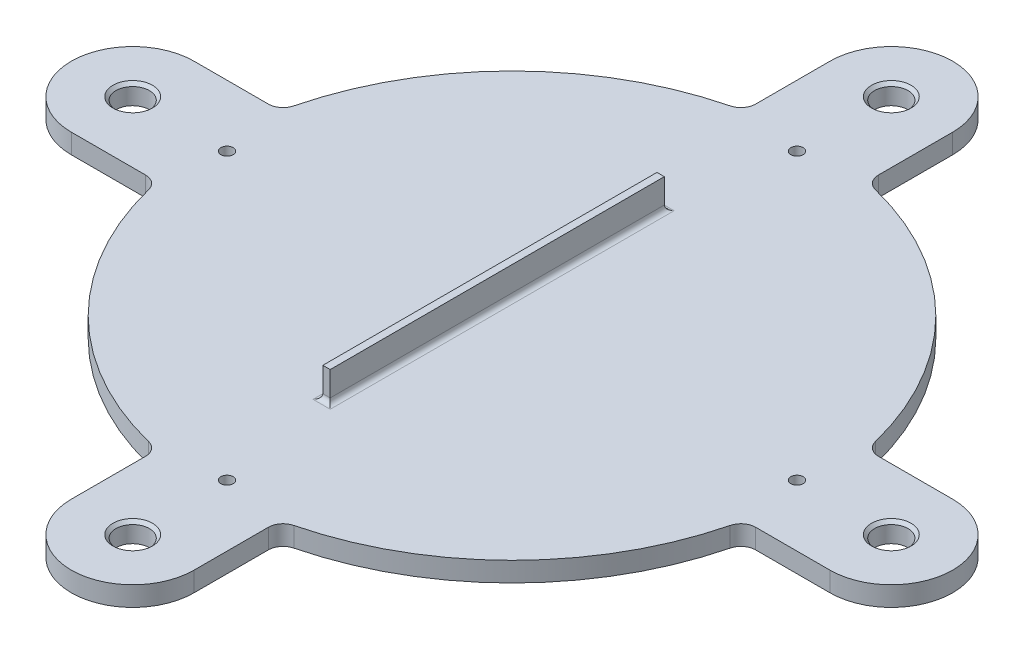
ISO-10303-21;
HEADER;
FILE_DESCRIPTION(('STEP AP214'),'2;1');
FILE_NAME('part.step','',(''),(''),'','','');
FILE_SCHEMA(('AUTOMOTIVE_DESIGN { 1 0 10303 214 1 1 1 1 }'));
ENDSEC;
DATA;
#1=APPLICATION_CONTEXT('core data for automotive mechanical design processes');
#2=APPLICATION_PROTOCOL_DEFINITION('international standard','automotive_design',2000,#1);
#3=PRODUCT_CONTEXT('',#1,'mechanical');
#4=PRODUCT('Part','Part','',(#3));
#5=PRODUCT_RELATED_PRODUCT_CATEGORY('part','',(#4));
#6=PRODUCT_DEFINITION_FORMATION('','',#4);
#7=PRODUCT_DEFINITION_CONTEXT('part definition',#1,'design');
#8=PRODUCT_DEFINITION('design','',#6,#7);
#9=PRODUCT_DEFINITION_SHAPE('','',#8);
#10=(LENGTH_UNIT() NAMED_UNIT(*) SI_UNIT(.MILLI.,.METRE.));
#11=(NAMED_UNIT(*) PLANE_ANGLE_UNIT() SI_UNIT($,.RADIAN.));
#12=(NAMED_UNIT(*) SI_UNIT($,.STERADIAN.) SOLID_ANGLE_UNIT());
#13=UNCERTAINTY_MEASURE_WITH_UNIT(LENGTH_MEASURE(1.E-05),#10,'distance_accuracy_value','');
#14=(GEOMETRIC_REPRESENTATION_CONTEXT(3) GLOBAL_UNCERTAINTY_ASSIGNED_CONTEXT((#13)) GLOBAL_UNIT_ASSIGNED_CONTEXT((#10,
#11,#12)) REPRESENTATION_CONTEXT('',''));
#15=CARTESIAN_POINT('',(0.,0.,0.));
#16=DIRECTION('',(0.,0.,1.));
#17=DIRECTION('',(1.,0.,0.));
#18=AXIS2_PLACEMENT_3D('',#15,#16,#17);
#19=CARTESIAN_POINT('',(0.,-4.,-77.2055273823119));
#20=DIRECTION('',(0.,1.,0.));
#21=DIRECTION('',(0.,0.,1.));
#22=AXIS2_PLACEMENT_3D('',#19,#20,#21);
#23=CYLINDRICAL_SURFACE('',#22,12.5);
#24=DIRECTION('',(0.,1.,0.));
#25=VECTOR('',#24,1.);
#26=CARTESIAN_POINT('',(12.5,-4.,-77.2055273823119));
#27=LINE('',#26,#25);
#28=CARTESIAN_POINT('',(12.5,-4.,-77.2055273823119));
#29=VERTEX_POINT('',#28);
#30=CARTESIAN_POINT('',(12.5,0.,-77.2055273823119));
#31=VERTEX_POINT('',#30);
#32=EDGE_CURVE('E449',#29,#31,#27,.T.);
#33=ORIENTED_EDGE('',*,*,#32,.F.);
#34=CARTESIAN_POINT('',(0.,-4.,-77.2055273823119));
#35=DIRECTION('',(0.,1.,0.));
#36=DIRECTION('',(0.,0.,1.));
#37=AXIS2_PLACEMENT_3D('',#34,#35,#36);
#38=CIRCLE('',#37,12.5);
#39=CARTESIAN_POINT('',(-12.5,-4.,-77.2055273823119));
#40=VERTEX_POINT('',#39);
#41=EDGE_CURVE('E455',#40,#29,#38,.F.);
#42=ORIENTED_EDGE('',*,*,#41,.F.);
#43=DIRECTION('',(0.,1.,0.));
#44=VECTOR('',#43,1.);
#45=CARTESIAN_POINT('',(-12.5,-4.,-77.2055273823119));
#46=LINE('',#45,#44);
#47=CARTESIAN_POINT('',(-12.5,0.,-77.2055273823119));
#48=VERTEX_POINT('',#47);
#49=EDGE_CURVE('E452',#48,#40,#46,.F.);
#50=ORIENTED_EDGE('',*,*,#49,.F.);
#51=CARTESIAN_POINT('',(0.,0.,-77.2055273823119));
#52=DIRECTION('',(0.,1.,0.));
#53=DIRECTION('',(0.,0.,1.));
#54=AXIS2_PLACEMENT_3D('',#51,#52,#53);
#55=CIRCLE('',#54,12.5);
#56=EDGE_CURVE('E457',#31,#48,#55,.T.);
#57=ORIENTED_EDGE('',*,*,#56,.F.);
#58=EDGE_LOOP('',(#33,#42,#50,#57));
#59=FACE_BOUND('',#58,.T.);
#60=ADVANCED_FACE('F38',(#59),#23,.T.);
#61=CARTESIAN_POINT('',(-77.2055273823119,0.,0.));
#62=DIRECTION('',(0.,1.,0.));
#63=DIRECTION('',(0.,0.,1.));
#64=AXIS2_PLACEMENT_3D('',#61,#62,#63);
#65=CYLINDRICAL_SURFACE('',#64,12.5);
#66=DIRECTION('',(0.,1.,0.));
#67=VECTOR('',#66,1.);
#68=CARTESIAN_POINT('',(-77.2055273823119,-4.,12.5));
#69=LINE('',#68,#67);
#70=CARTESIAN_POINT('',(-77.2055273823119,0.,12.5));
#71=VERTEX_POINT('',#70);
#72=CARTESIAN_POINT('',(-77.2055273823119,-4.,12.5));
#73=VERTEX_POINT('',#72);
#74=EDGE_CURVE('E439',#71,#73,#69,.F.);
#75=ORIENTED_EDGE('',*,*,#74,.F.);
#76=CARTESIAN_POINT('',(-77.2055273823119,0.,0.));
#77=DIRECTION('',(0.,1.,0.));
#78=DIRECTION('',(0.,0.,1.));
#79=AXIS2_PLACEMENT_3D('',#76,#77,#78);
#80=CIRCLE('',#79,12.5);
#81=CARTESIAN_POINT('',(-77.2055273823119,0.,-12.5));
#82=VERTEX_POINT('',#81);
#83=EDGE_CURVE('E445',#82,#71,#80,.T.);
#84=ORIENTED_EDGE('',*,*,#83,.F.);
#85=DIRECTION('',(0.,1.,0.));
#86=VECTOR('',#85,1.);
#87=CARTESIAN_POINT('',(-77.2055273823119,-4.,-12.5));
#88=LINE('',#87,#86);
#89=CARTESIAN_POINT('',(-77.2055273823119,-4.,-12.5));
#90=VERTEX_POINT('',#89);
#91=EDGE_CURVE('E442',#90,#82,#88,.T.);
#92=ORIENTED_EDGE('',*,*,#91,.F.);
#93=CARTESIAN_POINT('',(-77.2055273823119,-4.,0.));
#94=DIRECTION('',(0.,1.,0.));
#95=DIRECTION('',(0.,0.,1.));
#96=AXIS2_PLACEMENT_3D('',#93,#94,#95);
#97=CIRCLE('',#96,12.5);
#98=EDGE_CURVE('E447',#73,#90,#97,.F.);
#99=ORIENTED_EDGE('',*,*,#98,.F.);
#100=EDGE_LOOP('',(#75,#84,#92,#99));
#101=FACE_BOUND('',#100,.T.);
#102=ADVANCED_FACE('F581',(#101),#65,.T.);
#103=CARTESIAN_POINT('',(77.2055273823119,-4.,0.));
#104=DIRECTION('',(0.,1.,0.));
#105=DIRECTION('',(0.,0.,1.));
#106=AXIS2_PLACEMENT_3D('',#103,#104,#105);
#107=CYLINDRICAL_SURFACE('',#106,12.5);
#108=DIRECTION('',(0.,1.,0.));
#109=VECTOR('',#108,1.);
#110=CARTESIAN_POINT('',(77.2055273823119,-4.,12.5));
#111=LINE('',#110,#109);
#112=CARTESIAN_POINT('',(77.2055273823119,-4.,12.5));
#113=VERTEX_POINT('',#112);
#114=CARTESIAN_POINT('',(77.2055273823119,0.,12.5));
#115=VERTEX_POINT('',#114);
#116=EDGE_CURVE('E429',#113,#115,#111,.T.);
#117=ORIENTED_EDGE('',*,*,#116,.F.);
#118=CARTESIAN_POINT('',(77.2055273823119,-4.,0.));
#119=DIRECTION('',(0.,1.,0.));
#120=DIRECTION('',(0.,0.,1.));
#121=AXIS2_PLACEMENT_3D('',#118,#119,#120);
#122=CIRCLE('',#121,12.5);
#123=CARTESIAN_POINT('',(77.2055273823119,-4.,-12.5));
#124=VERTEX_POINT('',#123);
#125=EDGE_CURVE('E435',#124,#113,#122,.F.);
#126=ORIENTED_EDGE('',*,*,#125,.F.);
#127=DIRECTION('',(0.,1.,0.));
#128=VECTOR('',#127,1.);
#129=CARTESIAN_POINT('',(77.2055273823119,-4.,-12.5));
#130=LINE('',#129,#128);
#131=CARTESIAN_POINT('',(77.2055273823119,0.,-12.5));
#132=VERTEX_POINT('',#131);
#133=EDGE_CURVE('E432',#132,#124,#130,.F.);
#134=ORIENTED_EDGE('',*,*,#133,.F.);
#135=CARTESIAN_POINT('',(77.2055273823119,0.,0.));
#136=DIRECTION('',(0.,1.,0.));
#137=DIRECTION('',(0.,0.,1.));
#138=AXIS2_PLACEMENT_3D('',#135,#136,#137);
#139=CIRCLE('',#138,12.5);
#140=EDGE_CURVE('E437',#115,#132,#139,.T.);
#141=ORIENTED_EDGE('',*,*,#140,.F.);
#142=EDGE_LOOP('',(#117,#126,#134,#141));
#143=FACE_BOUND('',#142,.T.);
#144=ADVANCED_FACE('F587',(#143),#107,.T.);
#145=CARTESIAN_POINT('',(0.,-4.,77.2055273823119));
#146=DIRECTION('',(0.,1.,0.));
#147=DIRECTION('',(0.,0.,1.));
#148=AXIS2_PLACEMENT_3D('',#145,#146,#147);
#149=CYLINDRICAL_SURFACE('',#148,12.5);
#150=DIRECTION('',(0.,1.,0.));
#151=VECTOR('',#150,1.);
#152=CARTESIAN_POINT('',(-12.5,-4.,77.2055273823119));
#153=LINE('',#152,#151);
#154=CARTESIAN_POINT('',(-12.5,-4.,77.2055273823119));
#155=VERTEX_POINT('',#154);
#156=CARTESIAN_POINT('',(-12.5,0.,77.2055273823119));
#157=VERTEX_POINT('',#156);
#158=EDGE_CURVE('E402',#155,#157,#153,.T.);
#159=ORIENTED_EDGE('',*,*,#158,.F.);
#160=CARTESIAN_POINT('',(0.,-4.,77.2055273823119));
#161=DIRECTION('',(0.,1.,0.));
#162=DIRECTION('',(0.,0.,1.));
#163=AXIS2_PLACEMENT_3D('',#160,#161,#162);
#164=CIRCLE('',#163,12.5);
#165=CARTESIAN_POINT('',(12.5,-4.,77.2055273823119));
#166=VERTEX_POINT('',#165);
#167=EDGE_CURVE('E425',#166,#155,#164,.F.);
#168=ORIENTED_EDGE('',*,*,#167,.F.);
#169=DIRECTION('',(0.,1.,0.));
#170=VECTOR('',#169,1.);
#171=CARTESIAN_POINT('',(12.5,-4.,77.2055273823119));
#172=LINE('',#171,#170);
#173=CARTESIAN_POINT('',(12.5,0.,77.2055273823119));
#174=VERTEX_POINT('',#173);
#175=EDGE_CURVE('E422',#174,#166,#172,.F.);
#176=ORIENTED_EDGE('',*,*,#175,.F.);
#177=CARTESIAN_POINT('',(0.,0.,77.2055273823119));
#178=DIRECTION('',(0.,1.,0.));
#179=DIRECTION('',(0.,0.,1.));
#180=AXIS2_PLACEMENT_3D('',#177,#178,#179);
#181=CIRCLE('',#180,12.5);
#182=EDGE_CURVE('E427',#157,#174,#181,.T.);
#183=ORIENTED_EDGE('',*,*,#182,.F.);
#184=EDGE_LOOP('',(#159,#168,#176,#183));
#185=FACE_BOUND('',#184,.T.);
#186=ADVANCED_FACE('F662',(#185),#149,.T.);
#187=CARTESIAN_POINT('',(0.,0.,0.));
#188=DIRECTION('',(0.,1.,0.));
#189=DIRECTION('',(0.,0.,1.));
#190=AXIS2_PLACEMENT_3D('',#187,#188,#189);
#191=PLANE('',#190);
#192=DIRECTION('',(0.,0.,-1.));
#193=VECTOR('',#192,1.);
#194=CARTESIAN_POINT('',(-5.5,0.,-34.));
#195=LINE('',#194,#193);
#196=CARTESIAN_POINT('',(-5.5,0.,35.));
#197=VERTEX_POINT('',#196);
#198=CARTESIAN_POINT('',(-5.5,0.,-35.));
#199=VERTEX_POINT('',#198);
#200=EDGE_CURVE('E463',#197,#199,#195,.T.);
#201=ORIENTED_EDGE('',*,*,#200,.T.);
#202=DIRECTION('',(1.,0.,0.));
#203=VECTOR('',#202,1.);
#204=CARTESIAN_POINT('',(-3.,0.,-35.));
#205=LINE('',#204,#203);
#206=CARTESIAN_POINT('',(-2.,0.,-35.));
#207=VERTEX_POINT('',#206);
#208=EDGE_CURVE('E465',#199,#207,#205,.T.);
#209=ORIENTED_EDGE('',*,*,#208,.T.);
#210=DIRECTION('',(0.,0.,-1.));
#211=VECTOR('',#210,1.);
#212=CARTESIAN_POINT('',(-2.,0.,0.));
#213=LINE('',#212,#211);
#214=CARTESIAN_POINT('',(-2.,0.,35.));
#215=VERTEX_POINT('',#214);
#216=EDGE_CURVE('E461',#207,#215,#213,.F.);
#217=ORIENTED_EDGE('',*,*,#216,.T.);
#218=DIRECTION('',(1.,0.,0.));
#219=VECTOR('',#218,1.);
#220=CARTESIAN_POINT('',(-1.61907524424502E-13,0.,35.));
#221=LINE('',#220,#219);
#222=EDGE_CURVE('E459',#215,#197,#221,.F.);
#223=ORIENTED_EDGE('',*,*,#222,.T.);
#224=EDGE_LOOP('',(#201,#209,#217,#223));
#225=FACE_BOUND('',#224,.T.);
#226=CARTESIAN_POINT('',(-77.2055273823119,0.,0.));
#227=DIRECTION('',(0.,1.,0.));
#228=DIRECTION('',(0.,0.,1.));
#229=AXIS2_PLACEMENT_3D('',#226,#227,#228);
#230=CIRCLE('',#229,4.025);
#231=CARTESIAN_POINT('',(-77.2055273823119,0.,4.02500000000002));
#232=VERTEX_POINT('',#231);
#233=EDGE_CURVE('E482',#232,#232,#230,.T.);
#234=ORIENTED_EDGE('',*,*,#233,.F.);
#235=EDGE_LOOP('',(#234));
#236=FACE_BOUND('',#235,.T.);
#237=CARTESIAN_POINT('',(0.,0.,77.2055273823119));
#238=DIRECTION('',(0.,1.,0.));
#239=DIRECTION('',(0.,0.,1.));
#240=AXIS2_PLACEMENT_3D('',#237,#238,#239);
#241=CIRCLE('',#240,4.025);
#242=CARTESIAN_POINT('',(0.,0.,81.2305273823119));
#243=VERTEX_POINT('',#242);
#244=EDGE_CURVE('E497',#243,#243,#241,.T.);
#245=ORIENTED_EDGE('',*,*,#244,.F.);
#246=EDGE_LOOP('',(#245));
#247=FACE_BOUND('',#246,.T.);
#248=CARTESIAN_POINT('',(77.2055273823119,0.,0.));
#249=DIRECTION('',(0.,1.,0.));
#250=DIRECTION('',(0.,0.,1.));
#251=AXIS2_PLACEMENT_3D('',#248,#249,#250);
#252=CIRCLE('',#251,4.025);
#253=CARTESIAN_POINT('',(77.2055273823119,0.,4.025));
#254=VERTEX_POINT('',#253);
#255=EDGE_CURVE('E506',#254,#254,#252,.T.);
#256=ORIENTED_EDGE('',*,*,#255,.F.);
#257=EDGE_LOOP('',(#256));
#258=FACE_BOUND('',#257,.T.);
#259=CARTESIAN_POINT('',(0.,0.,-77.2055273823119));
#260=DIRECTION('',(0.,1.,0.));
#261=DIRECTION('',(0.,0.,1.));
#262=AXIS2_PLACEMENT_3D('',#259,#260,#261);
#263=CIRCLE('',#262,4.025);
#264=CARTESIAN_POINT('',(0.,0.,-73.1805273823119));
#265=VERTEX_POINT('',#264);
#266=EDGE_CURVE('E515',#265,#265,#263,.T.);
#267=ORIENTED_EDGE('',*,*,#266,.F.);
#268=EDGE_LOOP('',(#267));
#269=FACE_BOUND('',#268,.T.);
#270=CARTESIAN_POINT('',(-58.,0.,0.));
#271=DIRECTION('',(0.,1.,0.));
#272=DIRECTION('',(0.,0.,1.));
#273=AXIS2_PLACEMENT_3D('',#270,#271,#272);
#274=CIRCLE('',#273,1.25);
#275=CARTESIAN_POINT('',(-58.,0.,1.25));
#276=VERTEX_POINT('',#275);
#277=EDGE_CURVE('E416',#276,#276,#274,.T.);
#278=ORIENTED_EDGE('',*,*,#277,.F.);
#279=EDGE_LOOP('',(#278));
#280=FACE_BOUND('',#279,.T.);
#281=CARTESIAN_POINT('',(58.,0.,0.));
#282=DIRECTION('',(0.,1.,0.));
#283=DIRECTION('',(0.,0.,1.));
#284=AXIS2_PLACEMENT_3D('',#281,#282,#283);
#285=CIRCLE('',#284,1.25);
#286=CARTESIAN_POINT('',(58.,0.,1.25));
#287=VERTEX_POINT('',#286);
#288=EDGE_CURVE('E412',#287,#287,#285,.T.);
#289=ORIENTED_EDGE('',*,*,#288,.F.);
#290=EDGE_LOOP('',(#289));
#291=FACE_BOUND('',#290,.T.);
#292=CARTESIAN_POINT('',(0.,0.,58.));
#293=DIRECTION('',(0.,1.,0.));
#294=DIRECTION('',(0.,0.,1.));
#295=AXIS2_PLACEMENT_3D('',#292,#293,#294);
#296=CIRCLE('',#295,1.25);
#297=CARTESIAN_POINT('',(0.,0.,59.25));
#298=VERTEX_POINT('',#297);
#299=EDGE_CURVE('E408',#298,#298,#296,.T.);
#300=ORIENTED_EDGE('',*,*,#299,.F.);
#301=EDGE_LOOP('',(#300));
#302=FACE_BOUND('',#301,.T.);
#303=CARTESIAN_POINT('',(0.,0.,-58.));
#304=DIRECTION('',(0.,1.,0.));
#305=DIRECTION('',(0.,0.,1.));
#306=AXIS2_PLACEMENT_3D('',#303,#304,#305);
#307=CIRCLE('',#306,1.25);
#308=CARTESIAN_POINT('',(0.,0.,-56.75));
#309=VERTEX_POINT('',#308);
#310=EDGE_CURVE('E403',#309,#309,#307,.T.);
#311=ORIENTED_EDGE('',*,*,#310,.F.);
#312=EDGE_LOOP('',(#311));
#313=FACE_BOUND('',#312,.T.);
#314=DIRECTION('',(0.,0.,-1.));
#315=VECTOR('',#314,1.);
#316=CARTESIAN_POINT('',(12.5,0.,-59.7055273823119));
#317=LINE('',#316,#315);
#318=CARTESIAN_POINT('',(12.5,0.,-62.094685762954));
#319=VERTEX_POINT('',#318);
#320=EDGE_CURVE('E323',#319,#31,#317,.T.);
#321=ORIENTED_EDGE('',*,*,#320,.T.);
#322=ORIENTED_EDGE('',*,*,#56,.T.);
#323=DIRECTION('',(0.,0.,1.));
#324=VECTOR('',#323,1.);
#325=CARTESIAN_POINT('',(-12.5,0.,-59.7055273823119));
#326=LINE('',#325,#324);
#327=CARTESIAN_POINT('',(-12.5,0.,-62.094685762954));
#328=VERTEX_POINT('',#327);
#329=EDGE_CURVE('E270',#48,#328,#326,.T.);
#330=ORIENTED_EDGE('',*,*,#329,.T.);
#331=CARTESIAN_POINT('',(-15.5,0.,-62.094685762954));
#332=DIRECTION('',(0.,1.,0.));
#333=DIRECTION('',(0.,0.,1.));
#334=AXIS2_PLACEMENT_3D('',#331,#332,#333);
#335=CIRCLE('',#334,3.);
#336=CARTESIAN_POINT('',(-14.7734375,0.,-59.1839973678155));
#337=VERTEX_POINT('',#336);
#338=EDGE_CURVE('E366',#328,#337,#335,.F.);
#339=ORIENTED_EDGE('',*,*,#338,.T.);
#340=CARTESIAN_POINT('',(0.,0.,0.));
#341=DIRECTION('',(0.,1.,0.));
#342=DIRECTION('',(0.,0.,1.));
#343=AXIS2_PLACEMENT_3D('',#340,#341,#342);
#344=CIRCLE('',#343,61.);
#345=CARTESIAN_POINT('',(-59.1839973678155,0.,-14.7734375));
#346=VERTEX_POINT('',#345);
#347=EDGE_CURVE('E257',#337,#346,#344,.T.);
#348=ORIENTED_EDGE('',*,*,#347,.T.);
#349=CARTESIAN_POINT('',(-62.094685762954,0.,-15.5));
#350=DIRECTION('',(0.,1.,0.));
#351=DIRECTION('',(0.,0.,1.));
#352=AXIS2_PLACEMENT_3D('',#349,#350,#351);
#353=CIRCLE('',#352,3.);
#354=CARTESIAN_POINT('',(-62.094685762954,0.,-12.5));
#355=VERTEX_POINT('',#354);
#356=EDGE_CURVE('E371',#346,#355,#353,.F.);
#357=ORIENTED_EDGE('',*,*,#356,.T.);
#358=DIRECTION('',(-1.,0.,0.));
#359=VECTOR('',#358,1.);
#360=CARTESIAN_POINT('',(-59.7055273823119,0.,-12.5));
#361=LINE('',#360,#359);
#362=EDGE_CURVE('E260',#355,#82,#361,.T.);
#363=ORIENTED_EDGE('',*,*,#362,.T.);
#364=ORIENTED_EDGE('',*,*,#83,.T.);
#365=DIRECTION('',(1.,0.,0.));
#366=VECTOR('',#365,1.);
#367=CARTESIAN_POINT('',(-59.7055273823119,0.,12.5));
#368=LINE('',#367,#366);
#369=CARTESIAN_POINT('',(-62.094685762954,0.,12.5));
#370=VERTEX_POINT('',#369);
#371=EDGE_CURVE('E302',#71,#370,#368,.T.);
#372=ORIENTED_EDGE('',*,*,#371,.T.);
#373=CARTESIAN_POINT('',(-62.094685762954,0.,15.5));
#374=DIRECTION('',(0.,1.,0.));
#375=DIRECTION('',(0.,0.,1.));
#376=AXIS2_PLACEMENT_3D('',#373,#374,#375);
#377=CIRCLE('',#376,3.);
#378=CARTESIAN_POINT('',(-59.1839973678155,0.,14.7734375));
#379=VERTEX_POINT('',#378);
#380=EDGE_CURVE('E379',#370,#379,#377,.F.);
#381=ORIENTED_EDGE('',*,*,#380,.T.);
#382=CARTESIAN_POINT('',(0.,0.,0.));
#383=DIRECTION('',(0.,1.,0.));
#384=DIRECTION('',(0.,0.,1.));
#385=AXIS2_PLACEMENT_3D('',#382,#383,#384);
#386=CIRCLE('',#385,61.);
#387=CARTESIAN_POINT('',(-14.7734375,0.,59.1839973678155));
#388=VERTEX_POINT('',#387);
#389=EDGE_CURVE('E304',#379,#388,#386,.T.);
#390=ORIENTED_EDGE('',*,*,#389,.T.);
#391=CARTESIAN_POINT('',(-15.5,0.,62.094685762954));
#392=DIRECTION('',(0.,1.,0.));
#393=DIRECTION('',(0.,0.,1.));
#394=AXIS2_PLACEMENT_3D('',#391,#392,#393);
#395=CIRCLE('',#394,3.);
#396=CARTESIAN_POINT('',(-12.5,0.,62.094685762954));
#397=VERTEX_POINT('',#396);
#398=EDGE_CURVE('E375',#388,#397,#395,.F.);
#399=ORIENTED_EDGE('',*,*,#398,.T.);
#400=DIRECTION('',(0.,0.,1.));
#401=VECTOR('',#400,1.);
#402=CARTESIAN_POINT('',(-12.5,0.,59.7055273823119));
#403=LINE('',#402,#401);
#404=EDGE_CURVE('E307',#397,#157,#403,.T.);
#405=ORIENTED_EDGE('',*,*,#404,.T.);
#406=ORIENTED_EDGE('',*,*,#182,.T.);
#407=DIRECTION('',(0.,0.,-1.));
#408=VECTOR('',#407,1.);
#409=CARTESIAN_POINT('',(12.5,0.,59.7055273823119));
#410=LINE('',#409,#408);
#411=CARTESIAN_POINT('',(12.5,0.,62.094685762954));
#412=VERTEX_POINT('',#411);
#413=EDGE_CURVE('E310',#174,#412,#410,.T.);
#414=ORIENTED_EDGE('',*,*,#413,.T.);
#415=CARTESIAN_POINT('',(15.5,0.,62.094685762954));
#416=DIRECTION('',(0.,1.,0.));
#417=DIRECTION('',(0.,0.,1.));
#418=AXIS2_PLACEMENT_3D('',#415,#416,#417);
#419=CIRCLE('',#418,3.);
#420=CARTESIAN_POINT('',(14.7734375,0.,59.1839973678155));
#421=VERTEX_POINT('',#420);
#422=EDGE_CURVE('E397',#412,#421,#419,.F.);
#423=ORIENTED_EDGE('',*,*,#422,.T.);
#424=CARTESIAN_POINT('',(0.,0.,0.));
#425=DIRECTION('',(0.,1.,0.));
#426=DIRECTION('',(0.,0.,1.));
#427=AXIS2_PLACEMENT_3D('',#424,#425,#426);
#428=CIRCLE('',#427,61.);
#429=CARTESIAN_POINT('',(59.1839973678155,0.,14.7734375));
#430=VERTEX_POINT('',#429);
#431=EDGE_CURVE('E312',#421,#430,#428,.T.);
#432=ORIENTED_EDGE('',*,*,#431,.T.);
#433=CARTESIAN_POINT('',(62.094685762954,0.,15.5));
#434=DIRECTION('',(0.,1.,0.));
#435=DIRECTION('',(0.,0.,1.));
#436=AXIS2_PLACEMENT_3D('',#433,#434,#435);
#437=CIRCLE('',#436,3.);
#438=CARTESIAN_POINT('',(62.094685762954,0.,12.5));
#439=VERTEX_POINT('',#438);
#440=EDGE_CURVE('E393',#430,#439,#437,.F.);
#441=ORIENTED_EDGE('',*,*,#440,.T.);
#442=DIRECTION('',(1.,0.,0.));
#443=VECTOR('',#442,1.);
#444=CARTESIAN_POINT('',(59.7055273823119,0.,12.5));
#445=LINE('',#444,#443);
#446=EDGE_CURVE('E315',#439,#115,#445,.T.);
#447=ORIENTED_EDGE('',*,*,#446,.T.);
#448=ORIENTED_EDGE('',*,*,#140,.T.);
#449=DIRECTION('',(-1.,0.,0.));
#450=VECTOR('',#449,1.);
#451=CARTESIAN_POINT('',(59.7055273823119,0.,-12.5));
#452=LINE('',#451,#450);
#453=CARTESIAN_POINT('',(62.094685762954,0.,-12.5));
#454=VERTEX_POINT('',#453);
#455=EDGE_CURVE('E318',#132,#454,#452,.T.);
#456=ORIENTED_EDGE('',*,*,#455,.T.);
#457=CARTESIAN_POINT('',(62.094685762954,0.,-15.5));
#458=DIRECTION('',(0.,1.,0.));
#459=DIRECTION('',(0.,0.,1.));
#460=AXIS2_PLACEMENT_3D('',#457,#458,#459);
#461=CIRCLE('',#460,3.);
#462=CARTESIAN_POINT('',(59.1839973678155,0.,-14.7734375));
#463=VERTEX_POINT('',#462);
#464=EDGE_CURVE('E388',#454,#463,#461,.F.);
#465=ORIENTED_EDGE('',*,*,#464,.T.);
#466=CARTESIAN_POINT('',(0.,0.,0.));
#467=DIRECTION('',(0.,1.,0.));
#468=DIRECTION('',(0.,0.,1.));
#469=AXIS2_PLACEMENT_3D('',#466,#467,#468);
#470=CIRCLE('',#469,61.);
#471=CARTESIAN_POINT('',(14.7734375,0.,-59.1839973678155));
#472=VERTEX_POINT('',#471);
#473=EDGE_CURVE('E320',#463,#472,#470,.T.);
#474=ORIENTED_EDGE('',*,*,#473,.T.);
#475=CARTESIAN_POINT('',(15.5,0.,-62.094685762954));
#476=DIRECTION('',(0.,1.,0.));
#477=DIRECTION('',(0.,0.,1.));
#478=AXIS2_PLACEMENT_3D('',#475,#476,#477);
#479=CIRCLE('',#478,3.);
#480=EDGE_CURVE('E384',#472,#319,#479,.F.);
#481=ORIENTED_EDGE('',*,*,#480,.T.);
#482=EDGE_LOOP('',(#321,#322,#330,#339,#348,#357,#363,#364,#372,#381,#390,#399,#405,#406,#414,
#423,#432,#441,#447,#448,#456,#465,#474,#481));
#483=FACE_BOUND('',#482,.T.);
#484=ADVANCED_FACE('F569',(#225,#236,#247,#258,#269,#280,#291,#302,#313,#483),#191,.T.);
#485=CARTESIAN_POINT('',(0.,-4.,0.));
#486=DIRECTION('',(0.,1.,0.));
#487=DIRECTION('',(0.,0.,1.));
#488=AXIS2_PLACEMENT_3D('',#485,#486,#487);
#489=CYLINDRICAL_SURFACE('',#488,61.);
#490=ORIENTED_EDGE('',*,*,#347,.F.);
#491=DIRECTION('',(0.,1.,0.));
#492=VECTOR('',#491,1.);
#493=CARTESIAN_POINT('',(-14.7734375,-4.,-59.1839973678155));
#494=LINE('',#493,#492);
#495=CARTESIAN_POINT('',(-14.7734375,-4.,-59.1839973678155));
#496=VERTEX_POINT('',#495);
#497=EDGE_CURVE('E332',#337,#496,#494,.F.);
#498=ORIENTED_EDGE('',*,*,#497,.T.);
#499=CARTESIAN_POINT('',(0.,-4.,0.));
#500=DIRECTION('',(0.,1.,0.));
#501=DIRECTION('',(0.,0.,1.));
#502=AXIS2_PLACEMENT_3D('',#499,#500,#501);
#503=CIRCLE('',#502,61.);
#504=CARTESIAN_POINT('',(-59.1839973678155,-4.,-14.7734375));
#505=VERTEX_POINT('',#504);
#506=EDGE_CURVE('E266',#496,#505,#503,.T.);
#507=ORIENTED_EDGE('',*,*,#506,.T.);
#508=DIRECTION('',(0.,1.,0.));
#509=VECTOR('',#508,1.);
#510=CARTESIAN_POINT('',(-59.1839973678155,-4.,-14.7734375));
#511=LINE('',#510,#509);
#512=EDGE_CURVE('E329',#505,#346,#511,.T.);
#513=ORIENTED_EDGE('',*,*,#512,.T.);
#514=EDGE_LOOP('',(#490,#498,#507,#513));
#515=FACE_BOUND('',#514,.T.);
#516=ADVANCED_FACE('F661',(#515),#489,.T.);
#517=CARTESIAN_POINT('',(-12.5,-4.,-59.7055273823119));
#518=DIRECTION('',(-1.,0.,0.));
#519=DIRECTION('',(0.,0.,1.));
#520=AXIS2_PLACEMENT_3D('',#517,#518,#519);
#521=PLANE('',#520);
#522=ORIENTED_EDGE('',*,*,#329,.F.);
#523=ORIENTED_EDGE('',*,*,#49,.T.);
#524=DIRECTION('',(0.,0.,1.));
#525=VECTOR('',#524,1.);
#526=CARTESIAN_POINT('',(-12.5,-4.,-59.7055273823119));
#527=LINE('',#526,#525);
#528=CARTESIAN_POINT('',(-12.5,-4.,-62.094685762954));
#529=VERTEX_POINT('',#528);
#530=EDGE_CURVE('E297',#40,#529,#527,.T.);
#531=ORIENTED_EDGE('',*,*,#530,.T.);
#532=DIRECTION('',(0.,-1.,0.));
#533=VECTOR('',#532,1.);
#534=CARTESIAN_POINT('',(-12.5,0.,-62.094685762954));
#535=LINE('',#534,#533);
#536=EDGE_CURVE('E298',#529,#328,#535,.F.);
#537=ORIENTED_EDGE('',*,*,#536,.T.);
#538=EDGE_LOOP('',(#522,#523,#531,#537));
#539=FACE_BOUND('',#538,.T.);
#540=ADVANCED_FACE('F776',(#539),#521,.T.);
#541=CARTESIAN_POINT('',(12.5,-4.,-59.7055273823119));
#542=DIRECTION('',(1.,0.,0.));
#543=DIRECTION('',(0.,0.,-1.));
#544=AXIS2_PLACEMENT_3D('',#541,#542,#543);
#545=PLANE('',#544);
#546=DIRECTION('',(0.,0.,-1.));
#547=VECTOR('',#546,1.);
#548=CARTESIAN_POINT('',(12.5,-4.,-59.7055273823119));
#549=LINE('',#548,#547);
#550=CARTESIAN_POINT('',(12.5,-4.,-62.094685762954));
#551=VERTEX_POINT('',#550);
#552=EDGE_CURVE('E294',#551,#29,#549,.T.);
#553=ORIENTED_EDGE('',*,*,#552,.T.);
#554=ORIENTED_EDGE('',*,*,#32,.T.);
#555=ORIENTED_EDGE('',*,*,#320,.F.);
#556=DIRECTION('',(0.,-1.,0.));
#557=VECTOR('',#556,1.);
#558=CARTESIAN_POINT('',(12.5,-4.,-62.094685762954));
#559=LINE('',#558,#557);
#560=EDGE_CURVE('E351',#319,#551,#559,.T.);
#561=ORIENTED_EDGE('',*,*,#560,.T.);
#562=EDGE_LOOP('',(#553,#554,#555,#561));
#563=FACE_BOUND('',#562,.T.);
#564=ADVANCED_FACE('F770',(#563),#545,.T.);
#565=CARTESIAN_POINT('',(0.,-4.,0.));
#566=DIRECTION('',(0.,1.,0.));
#567=DIRECTION('',(0.,0.,1.));
#568=AXIS2_PLACEMENT_3D('',#565,#566,#567);
#569=CYLINDRICAL_SURFACE('',#568,61.);
#570=CARTESIAN_POINT('',(0.,-4.,0.));
#571=DIRECTION('',(0.,1.,0.));
#572=DIRECTION('',(0.,0.,1.));
#573=AXIS2_PLACEMENT_3D('',#570,#571,#572);
#574=CIRCLE('',#573,61.);
#575=CARTESIAN_POINT('',(59.1839973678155,-4.,-14.7734375));
#576=VERTEX_POINT('',#575);
#577=CARTESIAN_POINT('',(14.7734375,-4.,-59.1839973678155));
#578=VERTEX_POINT('',#577);
#579=EDGE_CURVE('E291',#576,#578,#574,.T.);
#580=ORIENTED_EDGE('',*,*,#579,.T.);
#581=DIRECTION('',(0.,1.,0.));
#582=VECTOR('',#581,1.);
#583=CARTESIAN_POINT('',(14.7734375,-4.,-59.1839973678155));
#584=LINE('',#583,#582);
#585=EDGE_CURVE('E348',#578,#472,#584,.T.);
#586=ORIENTED_EDGE('',*,*,#585,.T.);
#587=ORIENTED_EDGE('',*,*,#473,.F.);
#588=DIRECTION('',(0.,1.,0.));
#589=VECTOR('',#588,1.);
#590=CARTESIAN_POINT('',(59.1839973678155,-4.,-14.7734375));
#591=LINE('',#590,#589);
#592=EDGE_CURVE('E346',#463,#576,#591,.F.);
#593=ORIENTED_EDGE('',*,*,#592,.T.);
#594=EDGE_LOOP('',(#580,#586,#587,#593));
#595=FACE_BOUND('',#594,.T.);
#596=ADVANCED_FACE('F775',(#595),#569,.T.);
#597=CARTESIAN_POINT('',(59.7055273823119,-4.,-12.5));
#598=DIRECTION('',(0.,0.,-1.));
#599=DIRECTION('',(-1.,0.,0.));
#600=AXIS2_PLACEMENT_3D('',#597,#598,#599);
#601=PLANE('',#600);
#602=ORIENTED_EDGE('',*,*,#455,.F.);
#603=ORIENTED_EDGE('',*,*,#133,.T.);
#604=DIRECTION('',(-1.,0.,0.));
#605=VECTOR('',#604,1.);
#606=CARTESIAN_POINT('',(59.7055273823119,-4.,-12.5));
#607=LINE('',#606,#605);
#608=CARTESIAN_POINT('',(62.094685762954,-4.,-12.5));
#609=VERTEX_POINT('',#608);
#610=EDGE_CURVE('E289',#124,#609,#607,.T.);
#611=ORIENTED_EDGE('',*,*,#610,.T.);
#612=DIRECTION('',(0.,-1.,0.));
#613=VECTOR('',#612,1.);
#614=CARTESIAN_POINT('',(62.094685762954,0.,-12.5));
#615=LINE('',#614,#613);
#616=EDGE_CURVE('E353',#609,#454,#615,.F.);
#617=ORIENTED_EDGE('',*,*,#616,.T.);
#618=EDGE_LOOP('',(#602,#603,#611,#617));
#619=FACE_BOUND('',#618,.T.);
#620=ADVANCED_FACE('F831',(#619),#601,.T.);
#621=CARTESIAN_POINT('',(59.7055273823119,-4.,12.5));
#622=DIRECTION('',(0.,0.,1.));
#623=DIRECTION('',(1.,0.,0.));
#624=AXIS2_PLACEMENT_3D('',#621,#622,#623);
#625=PLANE('',#624);
#626=DIRECTION('',(1.,0.,0.));
#627=VECTOR('',#626,1.);
#628=CARTESIAN_POINT('',(59.7055273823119,-4.,12.5));
#629=LINE('',#628,#627);
#630=CARTESIAN_POINT('',(62.094685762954,-4.,12.5));
#631=VERTEX_POINT('',#630);
#632=EDGE_CURVE('E286',#631,#113,#629,.T.);
#633=ORIENTED_EDGE('',*,*,#632,.T.);
#634=ORIENTED_EDGE('',*,*,#116,.T.);
#635=ORIENTED_EDGE('',*,*,#446,.F.);
#636=DIRECTION('',(0.,-1.,0.));
#637=VECTOR('',#636,1.);
#638=CARTESIAN_POINT('',(62.094685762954,-4.,12.5));
#639=LINE('',#638,#637);
#640=EDGE_CURVE('E361',#439,#631,#639,.T.);
#641=ORIENTED_EDGE('',*,*,#640,.T.);
#642=EDGE_LOOP('',(#633,#634,#635,#641));
#643=FACE_BOUND('',#642,.T.);
#644=ADVANCED_FACE('F825',(#643),#625,.T.);
#645=CARTESIAN_POINT('',(0.,-4.,0.));
#646=DIRECTION('',(0.,1.,0.));
#647=DIRECTION('',(0.,0.,1.));
#648=AXIS2_PLACEMENT_3D('',#645,#646,#647);
#649=CYLINDRICAL_SURFACE('',#648,61.);
#650=CARTESIAN_POINT('',(0.,-4.,0.));
#651=DIRECTION('',(0.,1.,0.));
#652=DIRECTION('',(0.,0.,1.));
#653=AXIS2_PLACEMENT_3D('',#650,#651,#652);
#654=CIRCLE('',#653,61.);
#655=CARTESIAN_POINT('',(14.7734375,-4.,59.1839973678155));
#656=VERTEX_POINT('',#655);
#657=CARTESIAN_POINT('',(59.1839973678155,-4.,14.7734375));
#658=VERTEX_POINT('',#657);
#659=EDGE_CURVE('E283',#656,#658,#654,.T.);
#660=ORIENTED_EDGE('',*,*,#659,.T.);
#661=DIRECTION('',(0.,1.,0.));
#662=VECTOR('',#661,1.);
#663=CARTESIAN_POINT('',(59.1839973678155,-4.,14.7734375));
#664=LINE('',#663,#662);
#665=EDGE_CURVE('E358',#658,#430,#664,.T.);
#666=ORIENTED_EDGE('',*,*,#665,.T.);
#667=ORIENTED_EDGE('',*,*,#431,.F.);
#668=DIRECTION('',(0.,1.,0.));
#669=VECTOR('',#668,1.);
#670=CARTESIAN_POINT('',(14.7734375,-4.,59.1839973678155));
#671=LINE('',#670,#669);
#672=EDGE_CURVE('E356',#421,#656,#671,.F.);
#673=ORIENTED_EDGE('',*,*,#672,.T.);
#674=EDGE_LOOP('',(#660,#666,#667,#673));
#675=FACE_BOUND('',#674,.T.);
#676=ADVANCED_FACE('F830',(#675),#649,.T.);
#677=CARTESIAN_POINT('',(12.5,-4.,59.7055273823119));
#678=DIRECTION('',(1.,0.,0.));
#679=DIRECTION('',(0.,0.,-1.));
#680=AXIS2_PLACEMENT_3D('',#677,#678,#679);
#681=PLANE('',#680);
#682=ORIENTED_EDGE('',*,*,#413,.F.);
#683=ORIENTED_EDGE('',*,*,#175,.T.);
#684=DIRECTION('',(0.,0.,-1.));
#685=VECTOR('',#684,1.);
#686=CARTESIAN_POINT('',(12.5,-4.,59.7055273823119));
#687=LINE('',#686,#685);
#688=CARTESIAN_POINT('',(12.5,-4.,62.094685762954));
#689=VERTEX_POINT('',#688);
#690=EDGE_CURVE('E281',#166,#689,#687,.T.);
#691=ORIENTED_EDGE('',*,*,#690,.T.);
#692=DIRECTION('',(0.,-1.,0.));
#693=VECTOR('',#692,1.);
#694=CARTESIAN_POINT('',(12.5,0.,62.094685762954));
#695=LINE('',#694,#693);
#696=EDGE_CURVE('E363',#689,#412,#695,.F.);
#697=ORIENTED_EDGE('',*,*,#696,.T.);
#698=EDGE_LOOP('',(#682,#683,#691,#697));
#699=FACE_BOUND('',#698,.T.);
#700=ADVANCED_FACE('F860',(#699),#681,.T.);
#701=CARTESIAN_POINT('',(-12.5,-4.,59.7055273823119));
#702=DIRECTION('',(-1.,0.,0.));
#703=DIRECTION('',(0.,0.,1.));
#704=AXIS2_PLACEMENT_3D('',#701,#702,#703);
#705=PLANE('',#704);
#706=DIRECTION('',(0.,0.,1.));
#707=VECTOR('',#706,1.);
#708=CARTESIAN_POINT('',(-12.5,-4.,59.7055273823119));
#709=LINE('',#708,#707);
#710=CARTESIAN_POINT('',(-12.5,-4.,62.094685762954));
#711=VERTEX_POINT('',#710);
#712=EDGE_CURVE('E278',#711,#155,#709,.T.);
#713=ORIENTED_EDGE('',*,*,#712,.T.);
#714=ORIENTED_EDGE('',*,*,#158,.T.);
#715=ORIENTED_EDGE('',*,*,#404,.F.);
#716=DIRECTION('',(0.,-1.,0.));
#717=VECTOR('',#716,1.);
#718=CARTESIAN_POINT('',(-12.5,-4.,62.094685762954));
#719=LINE('',#718,#717);
#720=EDGE_CURVE('E341',#397,#711,#719,.T.);
#721=ORIENTED_EDGE('',*,*,#720,.T.);
#722=EDGE_LOOP('',(#713,#714,#715,#721));
#723=FACE_BOUND('',#722,.T.);
#724=ADVANCED_FACE('F855',(#723),#705,.T.);
#725=CARTESIAN_POINT('',(0.,-4.,0.));
#726=DIRECTION('',(0.,1.,0.));
#727=DIRECTION('',(0.,0.,1.));
#728=AXIS2_PLACEMENT_3D('',#725,#726,#727);
#729=CYLINDRICAL_SURFACE('',#728,61.);
#730=CARTESIAN_POINT('',(0.,-4.,0.));
#731=DIRECTION('',(0.,1.,0.));
#732=DIRECTION('',(0.,0.,1.));
#733=AXIS2_PLACEMENT_3D('',#730,#731,#732);
#734=CIRCLE('',#733,61.);
#735=CARTESIAN_POINT('',(-59.1839973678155,-4.,14.7734375));
#736=VERTEX_POINT('',#735);
#737=CARTESIAN_POINT('',(-14.7734375,-4.,59.1839973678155));
#738=VERTEX_POINT('',#737);
#739=EDGE_CURVE('E275',#736,#738,#734,.T.);
#740=ORIENTED_EDGE('',*,*,#739,.T.);
#741=DIRECTION('',(0.,1.,0.));
#742=VECTOR('',#741,1.);
#743=CARTESIAN_POINT('',(-14.7734375,-4.,59.1839973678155));
#744=LINE('',#743,#742);
#745=EDGE_CURVE('E338',#738,#388,#744,.T.);
#746=ORIENTED_EDGE('',*,*,#745,.T.);
#747=ORIENTED_EDGE('',*,*,#389,.F.);
#748=DIRECTION('',(0.,1.,0.));
#749=VECTOR('',#748,1.);
#750=CARTESIAN_POINT('',(-59.1839973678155,-4.,14.7734375));
#751=LINE('',#750,#749);
#752=EDGE_CURVE('E336',#379,#736,#751,.F.);
#753=ORIENTED_EDGE('',*,*,#752,.T.);
#754=EDGE_LOOP('',(#740,#746,#747,#753));
#755=FACE_BOUND('',#754,.T.);
#756=ADVANCED_FACE('F810',(#755),#729,.T.);
#757=CARTESIAN_POINT('',(-59.7055273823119,-4.,12.5));
#758=DIRECTION('',(0.,0.,1.));
#759=DIRECTION('',(1.,0.,0.));
#760=AXIS2_PLACEMENT_3D('',#757,#758,#759);
#761=PLANE('',#760);
#762=ORIENTED_EDGE('',*,*,#371,.F.);
#763=ORIENTED_EDGE('',*,*,#74,.T.);
#764=DIRECTION('',(1.,0.,0.));
#765=VECTOR('',#764,1.);
#766=CARTESIAN_POINT('',(-59.7055273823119,-4.,12.5));
#767=LINE('',#766,#765);
#768=CARTESIAN_POINT('',(-62.094685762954,-4.,12.5));
#769=VERTEX_POINT('',#768);
#770=EDGE_CURVE('E273',#73,#769,#767,.T.);
#771=ORIENTED_EDGE('',*,*,#770,.T.);
#772=DIRECTION('',(0.,-1.,0.));
#773=VECTOR('',#772,1.);
#774=CARTESIAN_POINT('',(-62.094685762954,0.,12.5));
#775=LINE('',#774,#773);
#776=EDGE_CURVE('E343',#769,#370,#775,.F.);
#777=ORIENTED_EDGE('',*,*,#776,.T.);
#778=EDGE_LOOP('',(#762,#763,#771,#777));
#779=FACE_BOUND('',#778,.T.);
#780=ADVANCED_FACE('F800',(#779),#761,.T.);
#781=CARTESIAN_POINT('',(-59.7055273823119,-4.,-12.5));
#782=DIRECTION('',(0.,0.,-1.));
#783=DIRECTION('',(-1.,0.,0.));
#784=AXIS2_PLACEMENT_3D('',#781,#782,#783);
#785=PLANE('',#784);
#786=DIRECTION('',(-1.,0.,0.));
#787=VECTOR('',#786,1.);
#788=CARTESIAN_POINT('',(-59.7055273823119,-4.,-12.5));
#789=LINE('',#788,#787);
#790=CARTESIAN_POINT('',(-62.094685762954,-4.,-12.5));
#791=VERTEX_POINT('',#790);
#792=EDGE_CURVE('E269',#791,#90,#789,.T.);
#793=ORIENTED_EDGE('',*,*,#792,.T.);
#794=ORIENTED_EDGE('',*,*,#91,.T.);
#795=ORIENTED_EDGE('',*,*,#362,.F.);
#796=DIRECTION('',(0.,-1.,0.));
#797=VECTOR('',#796,1.);
#798=CARTESIAN_POINT('',(-62.094685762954,-4.,-12.5));
#799=LINE('',#798,#797);
#800=EDGE_CURVE('E334',#355,#791,#799,.T.);
#801=ORIENTED_EDGE('',*,*,#800,.T.);
#802=EDGE_LOOP('',(#793,#794,#795,#801));
#803=FACE_BOUND('',#802,.T.);
#804=ADVANCED_FACE('F760',(#803),#785,.T.);
#805=CARTESIAN_POINT('',(0.,-4.,0.));
#806=DIRECTION('',(0.,1.,0.));
#807=DIRECTION('',(0.,0.,1.));
#808=AXIS2_PLACEMENT_3D('',#805,#806,#807);
#809=PLANE('',#808);
#810=CARTESIAN_POINT('',(-77.2055273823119,-4.,0.));
#811=DIRECTION('',(0.,1.,0.));
#812=DIRECTION('',(0.,0.,1.));
#813=AXIS2_PLACEMENT_3D('',#810,#811,#812);
#814=CIRCLE('',#813,3.4);
#815=CARTESIAN_POINT('',(-77.2055273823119,-4.,3.40000000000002));
#816=VERTEX_POINT('',#815);
#817=EDGE_CURVE('E492',#816,#816,#814,.T.);
#818=ORIENTED_EDGE('',*,*,#817,.T.);
#819=EDGE_LOOP('',(#818));
#820=FACE_BOUND('',#819,.T.);
#821=CARTESIAN_POINT('',(0.,-4.,77.2055273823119));
#822=DIRECTION('',(0.,1.,0.));
#823=DIRECTION('',(0.,0.,1.));
#824=AXIS2_PLACEMENT_3D('',#821,#822,#823);
#825=CIRCLE('',#824,3.4);
#826=CARTESIAN_POINT('',(0.,-4.,80.6055273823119));
#827=VERTEX_POINT('',#826);
#828=EDGE_CURVE('E503',#827,#827,#825,.T.);
#829=ORIENTED_EDGE('',*,*,#828,.T.);
#830=EDGE_LOOP('',(#829));
#831=FACE_BOUND('',#830,.T.);
#832=CARTESIAN_POINT('',(77.2055273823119,-4.,0.));
#833=DIRECTION('',(0.,1.,0.));
#834=DIRECTION('',(0.,0.,1.));
#835=AXIS2_PLACEMENT_3D('',#832,#833,#834);
#836=CIRCLE('',#835,3.4);
#837=CARTESIAN_POINT('',(77.2055273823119,-4.,3.4));
#838=VERTEX_POINT('',#837);
#839=EDGE_CURVE('E512',#838,#838,#836,.T.);
#840=ORIENTED_EDGE('',*,*,#839,.T.);
#841=EDGE_LOOP('',(#840));
#842=FACE_BOUND('',#841,.T.);
#843=CARTESIAN_POINT('',(0.,-4.,-77.2055273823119));
#844=DIRECTION('',(0.,1.,0.));
#845=DIRECTION('',(0.,0.,1.));
#846=AXIS2_PLACEMENT_3D('',#843,#844,#845);
#847=CIRCLE('',#846,3.4);
#848=CARTESIAN_POINT('',(0.,-4.,-73.8055273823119));
#849=VERTEX_POINT('',#848);
#850=EDGE_CURVE('E521',#849,#849,#847,.T.);
#851=ORIENTED_EDGE('',*,*,#850,.T.);
#852=EDGE_LOOP('',(#851));
#853=FACE_BOUND('',#852,.T.);
#854=CARTESIAN_POINT('',(0.,-4.,58.));
#855=DIRECTION('',(0.,-1.,0.));
#856=DIRECTION('',(0.,0.,-1.));
#857=AXIS2_PLACEMENT_3D('',#854,#855,#856);
#858=CIRCLE('',#857,3.);
#859=CARTESIAN_POINT('',(0.,-4.,55.));
#860=VERTEX_POINT('',#859);
#861=EDGE_CURVE('E534',#860,#860,#858,.T.);
#862=ORIENTED_EDGE('',*,*,#861,.F.);
#863=EDGE_LOOP('',(#862));
#864=FACE_BOUND('',#863,.T.);
#865=CARTESIAN_POINT('',(58.,-4.,0.));
#866=DIRECTION('',(0.,-1.,0.));
#867=DIRECTION('',(0.,0.,-1.));
#868=AXIS2_PLACEMENT_3D('',#865,#866,#867);
#869=CIRCLE('',#868,3.00000000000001);
#870=CARTESIAN_POINT('',(58.,-4.,-3.));
#871=VERTEX_POINT('',#870);
#872=EDGE_CURVE('E540',#871,#871,#869,.T.);
#873=ORIENTED_EDGE('',*,*,#872,.F.);
#874=EDGE_LOOP('',(#873));
#875=FACE_BOUND('',#874,.T.);
#876=CARTESIAN_POINT('',(0.,-4.,-58.));
#877=DIRECTION('',(0.,-1.,0.));
#878=DIRECTION('',(0.,0.,-1.));
#879=AXIS2_PLACEMENT_3D('',#876,#877,#878);
#880=CIRCLE('',#879,3.);
#881=CARTESIAN_POINT('',(0.,-4.,-61.));
#882=VERTEX_POINT('',#881);
#883=EDGE_CURVE('E546',#882,#882,#880,.T.);
#884=ORIENTED_EDGE('',*,*,#883,.F.);
#885=EDGE_LOOP('',(#884));
#886=FACE_BOUND('',#885,.T.);
#887=CARTESIAN_POINT('',(-58.,-4.,0.));
#888=DIRECTION('',(0.,-1.,0.));
#889=DIRECTION('',(0.,0.,-1.));
#890=AXIS2_PLACEMENT_3D('',#887,#888,#889);
#891=CIRCLE('',#890,3.);
#892=CARTESIAN_POINT('',(-58.,-4.,-3.00000000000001));
#893=VERTEX_POINT('',#892);
#894=EDGE_CURVE('E406',#893,#893,#891,.T.);
#895=ORIENTED_EDGE('',*,*,#894,.F.);
#896=EDGE_LOOP('',(#895));
#897=FACE_BOUND('',#896,.T.);
#898=ORIENTED_EDGE('',*,*,#530,.F.);
#899=ORIENTED_EDGE('',*,*,#41,.T.);
#900=ORIENTED_EDGE('',*,*,#552,.F.);
#901=CARTESIAN_POINT('',(15.5,-4.,-62.094685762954));
#902=DIRECTION('',(0.,1.,0.));
#903=DIRECTION('',(0.,0.,1.));
#904=AXIS2_PLACEMENT_3D('',#901,#902,#903);
#905=CIRCLE('',#904,3.);
#906=EDGE_CURVE('E386',#551,#578,#905,.T.);
#907=ORIENTED_EDGE('',*,*,#906,.T.);
#908=ORIENTED_EDGE('',*,*,#579,.F.);
#909=CARTESIAN_POINT('',(62.094685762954,-4.,-15.5));
#910=DIRECTION('',(0.,1.,0.));
#911=DIRECTION('',(0.,0.,1.));
#912=AXIS2_PLACEMENT_3D('',#909,#910,#911);
#913=CIRCLE('',#912,3.);
#914=EDGE_CURVE('E390',#576,#609,#913,.T.);
#915=ORIENTED_EDGE('',*,*,#914,.T.);
#916=ORIENTED_EDGE('',*,*,#610,.F.);
#917=ORIENTED_EDGE('',*,*,#125,.T.);
#918=ORIENTED_EDGE('',*,*,#632,.F.);
#919=CARTESIAN_POINT('',(62.094685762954,-4.,15.5));
#920=DIRECTION('',(0.,1.,0.));
#921=DIRECTION('',(0.,0.,1.));
#922=AXIS2_PLACEMENT_3D('',#919,#920,#921);
#923=CIRCLE('',#922,3.);
#924=EDGE_CURVE('E395',#631,#658,#923,.T.);
#925=ORIENTED_EDGE('',*,*,#924,.T.);
#926=ORIENTED_EDGE('',*,*,#659,.F.);
#927=CARTESIAN_POINT('',(15.5,-4.,62.094685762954));
#928=DIRECTION('',(0.,1.,0.));
#929=DIRECTION('',(0.,0.,1.));
#930=AXIS2_PLACEMENT_3D('',#927,#928,#929);
#931=CIRCLE('',#930,3.);
#932=EDGE_CURVE('E399',#656,#689,#931,.T.);
#933=ORIENTED_EDGE('',*,*,#932,.T.);
#934=ORIENTED_EDGE('',*,*,#690,.F.);
#935=ORIENTED_EDGE('',*,*,#167,.T.);
#936=ORIENTED_EDGE('',*,*,#712,.F.);
#937=CARTESIAN_POINT('',(-15.5,-4.,62.094685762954));
#938=DIRECTION('',(0.,1.,0.));
#939=DIRECTION('',(0.,0.,1.));
#940=AXIS2_PLACEMENT_3D('',#937,#938,#939);
#941=CIRCLE('',#940,3.);
#942=EDGE_CURVE('E377',#711,#738,#941,.T.);
#943=ORIENTED_EDGE('',*,*,#942,.T.);
#944=ORIENTED_EDGE('',*,*,#739,.F.);
#945=CARTESIAN_POINT('',(-62.094685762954,-4.,15.5));
#946=DIRECTION('',(0.,1.,0.));
#947=DIRECTION('',(0.,0.,1.));
#948=AXIS2_PLACEMENT_3D('',#945,#946,#947);
#949=CIRCLE('',#948,3.);
#950=EDGE_CURVE('E381',#736,#769,#949,.T.);
#951=ORIENTED_EDGE('',*,*,#950,.T.);
#952=ORIENTED_EDGE('',*,*,#770,.F.);
#953=ORIENTED_EDGE('',*,*,#98,.T.);
#954=ORIENTED_EDGE('',*,*,#792,.F.);
#955=CARTESIAN_POINT('',(-62.094685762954,-4.,-15.5));
#956=DIRECTION('',(0.,1.,0.));
#957=DIRECTION('',(0.,0.,1.));
#958=AXIS2_PLACEMENT_3D('',#955,#956,#957);
#959=CIRCLE('',#958,3.);
#960=EDGE_CURVE('E373',#791,#505,#959,.T.);
#961=ORIENTED_EDGE('',*,*,#960,.T.);
#962=ORIENTED_EDGE('',*,*,#506,.F.);
#963=CARTESIAN_POINT('',(-15.5,-4.,-62.094685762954));
#964=DIRECTION('',(0.,1.,0.));
#965=DIRECTION('',(0.,0.,1.));
#966=AXIS2_PLACEMENT_3D('',#963,#964,#965);
#967=CIRCLE('',#966,3.);
#968=EDGE_CURVE('E368',#496,#529,#967,.T.);
#969=ORIENTED_EDGE('',*,*,#968,.T.);
#970=EDGE_LOOP('',(#898,#899,#900,#907,#908,#915,#916,#917,#918,#925,#926,#933,#934,#935,#936,
#943,#944,#951,#952,#953,#954,#961,#962,#969));
#971=FACE_BOUND('',#970,.T.);
#972=ADVANCED_FACE('F754',(#820,#831,#842,#853,#864,#875,#886,#897,#971),#809,.F.);
#973=CARTESIAN_POINT('',(-15.5,-4.,-62.094685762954));
#974=DIRECTION('',(0.,1.,0.));
#975=DIRECTION('',(0.,0.,1.));
#976=AXIS2_PLACEMENT_3D('',#973,#974,#975);
#977=CYLINDRICAL_SURFACE('',#976,3.);
#978=ORIENTED_EDGE('',*,*,#968,.F.);
#979=ORIENTED_EDGE('',*,*,#497,.F.);
#980=ORIENTED_EDGE('',*,*,#338,.F.);
#981=ORIENTED_EDGE('',*,*,#536,.F.);
#982=EDGE_LOOP('',(#978,#979,#980,#981));
#983=FACE_BOUND('',#982,.T.);
#984=ADVANCED_FACE('F759',(#983),#977,.F.);
#985=CARTESIAN_POINT('',(-62.094685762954,-4.,-15.5));
#986=DIRECTION('',(0.,1.,0.));
#987=DIRECTION('',(0.,0.,1.));
#988=AXIS2_PLACEMENT_3D('',#985,#986,#987);
#989=CYLINDRICAL_SURFACE('',#988,3.);
#990=ORIENTED_EDGE('',*,*,#960,.F.);
#991=ORIENTED_EDGE('',*,*,#800,.F.);
#992=ORIENTED_EDGE('',*,*,#356,.F.);
#993=ORIENTED_EDGE('',*,*,#512,.F.);
#994=EDGE_LOOP('',(#990,#991,#992,#993));
#995=FACE_BOUND('',#994,.T.);
#996=ADVANCED_FACE('F1062',(#995),#989,.F.);
#997=CARTESIAN_POINT('',(-15.5,-4.,62.094685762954));
#998=DIRECTION('',(0.,1.,0.));
#999=DIRECTION('',(0.,0.,1.));
#1000=AXIS2_PLACEMENT_3D('',#997,#998,#999);
#1001=CYLINDRICAL_SURFACE('',#1000,3.);
#1002=ORIENTED_EDGE('',*,*,#942,.F.);
#1003=ORIENTED_EDGE('',*,*,#720,.F.);
#1004=ORIENTED_EDGE('',*,*,#398,.F.);
#1005=ORIENTED_EDGE('',*,*,#745,.F.);
#1006=EDGE_LOOP('',(#1002,#1003,#1004,#1005));
#1007=FACE_BOUND('',#1006,.T.);
#1008=ADVANCED_FACE('F1052',(#1007),#1001,.F.);
#1009=CARTESIAN_POINT('',(-62.094685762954,-4.,15.5));
#1010=DIRECTION('',(0.,1.,0.));
#1011=DIRECTION('',(0.,0.,1.));
#1012=AXIS2_PLACEMENT_3D('',#1009,#1010,#1011);
#1013=CYLINDRICAL_SURFACE('',#1012,3.);
#1014=ORIENTED_EDGE('',*,*,#950,.F.);
#1015=ORIENTED_EDGE('',*,*,#752,.F.);
#1016=ORIENTED_EDGE('',*,*,#380,.F.);
#1017=ORIENTED_EDGE('',*,*,#776,.F.);
#1018=EDGE_LOOP('',(#1014,#1015,#1016,#1017));
#1019=FACE_BOUND('',#1018,.T.);
#1020=ADVANCED_FACE('F1042',(#1019),#1013,.F.);
#1021=CARTESIAN_POINT('',(15.5,-4.,-62.094685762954));
#1022=DIRECTION('',(0.,1.,0.));
#1023=DIRECTION('',(0.,0.,1.));
#1024=AXIS2_PLACEMENT_3D('',#1021,#1022,#1023);
#1025=CYLINDRICAL_SURFACE('',#1024,3.);
#1026=ORIENTED_EDGE('',*,*,#906,.F.);
#1027=ORIENTED_EDGE('',*,*,#560,.F.);
#1028=ORIENTED_EDGE('',*,*,#480,.F.);
#1029=ORIENTED_EDGE('',*,*,#585,.F.);
#1030=EDGE_LOOP('',(#1026,#1027,#1028,#1029));
#1031=FACE_BOUND('',#1030,.T.);
#1032=ADVANCED_FACE('F1032',(#1031),#1025,.F.);
#1033=CARTESIAN_POINT('',(62.094685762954,-4.,-15.5));
#1034=DIRECTION('',(0.,1.,0.));
#1035=DIRECTION('',(0.,0.,1.));
#1036=AXIS2_PLACEMENT_3D('',#1033,#1034,#1035);
#1037=CYLINDRICAL_SURFACE('',#1036,3.);
#1038=ORIENTED_EDGE('',*,*,#914,.F.);
#1039=ORIENTED_EDGE('',*,*,#592,.F.);
#1040=ORIENTED_EDGE('',*,*,#464,.F.);
#1041=ORIENTED_EDGE('',*,*,#616,.F.);
#1042=EDGE_LOOP('',(#1038,#1039,#1040,#1041));
#1043=FACE_BOUND('',#1042,.T.);
#1044=ADVANCED_FACE('F1022',(#1043),#1037,.F.);
#1045=CARTESIAN_POINT('',(62.094685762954,-4.,15.5));
#1046=DIRECTION('',(0.,1.,0.));
#1047=DIRECTION('',(0.,0.,1.));
#1048=AXIS2_PLACEMENT_3D('',#1045,#1046,#1047);
#1049=CYLINDRICAL_SURFACE('',#1048,3.);
#1050=ORIENTED_EDGE('',*,*,#924,.F.);
#1051=ORIENTED_EDGE('',*,*,#640,.F.);
#1052=ORIENTED_EDGE('',*,*,#440,.F.);
#1053=ORIENTED_EDGE('',*,*,#665,.F.);
#1054=EDGE_LOOP('',(#1050,#1051,#1052,#1053));
#1055=FACE_BOUND('',#1054,.T.);
#1056=ADVANCED_FACE('F1012',(#1055),#1049,.F.);
#1057=CARTESIAN_POINT('',(15.5,-4.,62.094685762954));
#1058=DIRECTION('',(0.,1.,0.));
#1059=DIRECTION('',(0.,0.,1.));
#1060=AXIS2_PLACEMENT_3D('',#1057,#1058,#1059);
#1061=CYLINDRICAL_SURFACE('',#1060,3.);
#1062=ORIENTED_EDGE('',*,*,#932,.F.);
#1063=ORIENTED_EDGE('',*,*,#672,.F.);
#1064=ORIENTED_EDGE('',*,*,#422,.F.);
#1065=ORIENTED_EDGE('',*,*,#696,.F.);
#1066=EDGE_LOOP('',(#1062,#1063,#1064,#1065));
#1067=FACE_BOUND('',#1066,.T.);
#1068=ADVANCED_FACE('F651',(#1067),#1061,.F.);
#1069=CARTESIAN_POINT('',(-1.57281595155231E-13,6.,34.));
#1070=DIRECTION('',(0.,0.,-1.));
#1071=DIRECTION('',(-1.,0.,0.));
#1072=AXIS2_PLACEMENT_3D('',#1069,#1070,#1071);
#1073=PLANE('',#1072);
#1074=DIRECTION('',(0.,-1.,0.));
#1075=VECTOR('',#1074,1.);
#1076=CARTESIAN_POINT('',(-4.5,6.,34.));
#1077=LINE('',#1076,#1075);
#1078=CARTESIAN_POINT('',(-4.5,6.,34.));
#1079=VERTEX_POINT('',#1078);
#1080=CARTESIAN_POINT('',(-4.5,1.,34.));
#1081=VERTEX_POINT('',#1080);
#1082=EDGE_CURVE('E556',#1079,#1081,#1077,.T.);
#1083=ORIENTED_EDGE('',*,*,#1082,.T.);
#1084=DIRECTION('',(1.,0.,0.));
#1085=VECTOR('',#1084,1.);
#1086=CARTESIAN_POINT('',(-1.57281595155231E-13,1.,34.));
#1087=LINE('',#1086,#1085);
#1088=CARTESIAN_POINT('',(-3.,1.,34.));
#1089=VERTEX_POINT('',#1088);
#1090=EDGE_CURVE('E11',#1081,#1089,#1087,.T.);
#1091=ORIENTED_EDGE('',*,*,#1090,.T.);
#1092=DIRECTION('',(0.,-1.,0.));
#1093=VECTOR('',#1092,1.);
#1094=CARTESIAN_POINT('',(-3.,6.,34.));
#1095=LINE('',#1094,#1093);
#1096=CARTESIAN_POINT('',(-3.,6.,34.));
#1097=VERTEX_POINT('',#1096);
#1098=EDGE_CURVE('E239',#1097,#1089,#1095,.T.);
#1099=ORIENTED_EDGE('',*,*,#1098,.F.);
#1100=DIRECTION('',(1.,0.,0.));
#1101=VECTOR('',#1100,1.);
#1102=CARTESIAN_POINT('',(-1.57281595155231E-13,6.,34.));
#1103=LINE('',#1102,#1101);
#1104=EDGE_CURVE('E247',#1079,#1097,#1103,.T.);
#1105=ORIENTED_EDGE('',*,*,#1104,.F.);
#1106=EDGE_LOOP('',(#1083,#1091,#1099,#1105));
#1107=FACE_BOUND('',#1106,.T.);
#1108=ADVANCED_FACE('F256',(#1107),#1073,.F.);
#1109=CARTESIAN_POINT('',(-3.,6.,0.));
#1110=DIRECTION('',(-1.,0.,0.));
#1111=DIRECTION('',(0.,0.,1.));
#1112=AXIS2_PLACEMENT_3D('',#1109,#1110,#1111);
#1113=PLANE('',#1112);
#1114=ORIENTED_EDGE('',*,*,#1098,.T.);
#1115=DIRECTION('',(0.,0.,-1.));
#1116=VECTOR('',#1115,1.);
#1117=CARTESIAN_POINT('',(-3.,1.,0.));
#1118=LINE('',#1117,#1116);
#1119=CARTESIAN_POINT('',(-3.,1.,-34.));
#1120=VERTEX_POINT('',#1119);
#1121=EDGE_CURVE('E47',#1089,#1120,#1118,.T.);
#1122=ORIENTED_EDGE('',*,*,#1121,.T.);
#1123=DIRECTION('',(0.,-1.,0.));
#1124=VECTOR('',#1123,1.);
#1125=CARTESIAN_POINT('',(-3.,6.,-34.));
#1126=LINE('',#1125,#1124);
#1127=CARTESIAN_POINT('',(-3.,6.,-34.));
#1128=VERTEX_POINT('',#1127);
#1129=EDGE_CURVE('E242',#1128,#1120,#1126,.T.);
#1130=ORIENTED_EDGE('',*,*,#1129,.F.);
#1131=DIRECTION('',(0.,0.,-1.));
#1132=VECTOR('',#1131,1.);
#1133=CARTESIAN_POINT('',(-3.,6.,0.));
#1134=LINE('',#1133,#1132);
#1135=EDGE_CURVE('E236',#1097,#1128,#1134,.T.);
#1136=ORIENTED_EDGE('',*,*,#1135,.F.);
#1137=EDGE_LOOP('',(#1114,#1122,#1130,#1136));
#1138=FACE_BOUND('',#1137,.T.);
#1139=ADVANCED_FACE('F238',(#1138),#1113,.F.);
#1140=CARTESIAN_POINT('',(-1.57281595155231E-13,6.,-34.));
#1141=DIRECTION('',(0.,0.,-1.));
#1142=DIRECTION('',(-1.,0.,0.));
#1143=AXIS2_PLACEMENT_3D('',#1140,#1141,#1142);
#1144=PLANE('',#1143);
#1145=ORIENTED_EDGE('',*,*,#1129,.T.);
#1146=DIRECTION('',(1.,0.,0.));
#1147=VECTOR('',#1146,1.);
#1148=CARTESIAN_POINT('',(-4.5,1.,-34.));
#1149=LINE('',#1148,#1147);
#1150=CARTESIAN_POINT('',(-4.5,1.,-34.));
#1151=VERTEX_POINT('',#1150);
#1152=EDGE_CURVE('E468',#1120,#1151,#1149,.F.);
#1153=ORIENTED_EDGE('',*,*,#1152,.T.);
#1154=DIRECTION('',(0.,-1.,0.));
#1155=VECTOR('',#1154,1.);
#1156=CARTESIAN_POINT('',(-4.5,6.,-34.));
#1157=LINE('',#1156,#1155);
#1158=CARTESIAN_POINT('',(-4.5,6.,-34.));
#1159=VERTEX_POINT('',#1158);
#1160=EDGE_CURVE('E262',#1159,#1151,#1157,.T.);
#1161=ORIENTED_EDGE('',*,*,#1160,.F.);
#1162=DIRECTION('',(1.,0.,0.));
#1163=VECTOR('',#1162,1.);
#1164=CARTESIAN_POINT('',(-1.57281595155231E-13,6.,-34.));
#1165=LINE('',#1164,#1163);
#1166=EDGE_CURVE('E246',#1159,#1128,#1165,.T.);
#1167=ORIENTED_EDGE('',*,*,#1166,.T.);
#1168=EDGE_LOOP('',(#1145,#1153,#1161,#1167));
#1169=FACE_BOUND('',#1168,.T.);
#1170=ADVANCED_FACE('F559',(#1169),#1144,.T.);
#1171=CARTESIAN_POINT('',(-4.5,6.,0.));
#1172=DIRECTION('',(-1.,0.,0.));
#1173=DIRECTION('',(0.,0.,1.));
#1174=AXIS2_PLACEMENT_3D('',#1171,#1172,#1173);
#1175=PLANE('',#1174);
#1176=ORIENTED_EDGE('',*,*,#1160,.T.);
#1177=DIRECTION('',(0.,0.,-1.));
#1178=VECTOR('',#1177,1.);
#1179=CARTESIAN_POINT('',(-4.5,1.,34.));
#1180=LINE('',#1179,#1178);
#1181=EDGE_CURVE('E61',#1151,#1081,#1180,.F.);
#1182=ORIENTED_EDGE('',*,*,#1181,.T.);
#1183=ORIENTED_EDGE('',*,*,#1082,.F.);
#1184=DIRECTION('',(0.,0.,-1.));
#1185=VECTOR('',#1184,1.);
#1186=CARTESIAN_POINT('',(-4.5,6.,0.));
#1187=LINE('',#1186,#1185);
#1188=EDGE_CURVE('E253',#1079,#1159,#1187,.T.);
#1189=ORIENTED_EDGE('',*,*,#1188,.T.);
#1190=EDGE_LOOP('',(#1176,#1182,#1183,#1189));
#1191=FACE_BOUND('',#1190,.T.);
#1192=ADVANCED_FACE('F557',(#1191),#1175,.T.);
#1193=CARTESIAN_POINT('',(0.,6.,0.));
#1194=DIRECTION('',(0.,1.,0.));
#1195=DIRECTION('',(0.,0.,1.));
#1196=AXIS2_PLACEMENT_3D('',#1193,#1194,#1195);
#1197=PLANE('',#1196);
#1198=ORIENTED_EDGE('',*,*,#1104,.T.);
#1199=ORIENTED_EDGE('',*,*,#1135,.T.);
#1200=ORIENTED_EDGE('',*,*,#1166,.F.);
#1201=ORIENTED_EDGE('',*,*,#1188,.F.);
#1202=EDGE_LOOP('',(#1198,#1199,#1200,#1201));
#1203=FACE_BOUND('',#1202,.T.);
#1204=ADVANCED_FACE('F251',(#1203),#1197,.T.);
#1205=CARTESIAN_POINT('',(-58.,-2.,0.));
#1206=DIRECTION('',(0.,-1.,0.));
#1207=DIRECTION('',(0.,0.,-1.));
#1208=AXIS2_PLACEMENT_3D('',#1205,#1206,#1207);
#1209=CYLINDRICAL_SURFACE('',#1208,3.);
#1210=CARTESIAN_POINT('',(-58.,-2.,0.));
#1211=DIRECTION('',(0.,-1.,0.));
#1212=DIRECTION('',(0.,0.,-1.));
#1213=AXIS2_PLACEMENT_3D('',#1210,#1211,#1212);
#1214=CIRCLE('',#1213,3.);
#1215=CARTESIAN_POINT('',(-58.,-2.,-3.00000000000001));
#1216=VERTEX_POINT('',#1215);
#1217=EDGE_CURVE('E549',#1216,#1216,#1214,.T.);
#1218=ORIENTED_EDGE('',*,*,#1217,.F.);
#1219=EDGE_LOOP('',(#1218));
#1220=FACE_BOUND('',#1219,.T.);
#1221=ORIENTED_EDGE('',*,*,#894,.T.);
#1222=EDGE_LOOP('',(#1221));
#1223=FACE_BOUND('',#1222,.T.);
#1224=ADVANCED_FACE('F968',(#1220,#1223),#1209,.F.);
#1225=CARTESIAN_POINT('',(-58.,-2.,0.));
#1226=DIRECTION('',(0.,-1.,0.));
#1227=DIRECTION('',(0.,0.,-1.));
#1228=AXIS2_PLACEMENT_3D('',#1225,#1226,#1227);
#1229=PLANE('',#1228);
#1230=CARTESIAN_POINT('',(-58.,-2.,0.));
#1231=DIRECTION('',(0.,-1.,0.));
#1232=DIRECTION('',(0.,0.,-1.));
#1233=AXIS2_PLACEMENT_3D('',#1230,#1231,#1232);
#1234=CIRCLE('',#1233,1.25);
#1235=CARTESIAN_POINT('',(-58.,-2.,-1.25));
#1236=VERTEX_POINT('',#1235);
#1237=EDGE_CURVE('E419',#1236,#1236,#1234,.T.);
#1238=ORIENTED_EDGE('',*,*,#1237,.F.);
#1239=EDGE_LOOP('',(#1238));
#1240=FACE_BOUND('',#1239,.T.);
#1241=ORIENTED_EDGE('',*,*,#1217,.T.);
#1242=EDGE_LOOP('',(#1241));
#1243=FACE_BOUND('',#1242,.T.);
#1244=ADVANCED_FACE('F963',(#1240,#1243),#1229,.T.);
#1245=CARTESIAN_POINT('',(0.,-2.,-58.));
#1246=DIRECTION('',(0.,-1.,0.));
#1247=DIRECTION('',(0.,0.,-1.));
#1248=AXIS2_PLACEMENT_3D('',#1245,#1246,#1247);
#1249=CYLINDRICAL_SURFACE('',#1248,3.);
#1250=CARTESIAN_POINT('',(0.,-2.,-58.));
#1251=DIRECTION('',(0.,-1.,0.));
#1252=DIRECTION('',(0.,0.,-1.));
#1253=AXIS2_PLACEMENT_3D('',#1250,#1251,#1252);
#1254=CIRCLE('',#1253,3.);
#1255=CARTESIAN_POINT('',(0.,-2.,-61.));
#1256=VERTEX_POINT('',#1255);
#1257=EDGE_CURVE('E543',#1256,#1256,#1254,.T.);
#1258=ORIENTED_EDGE('',*,*,#1257,.F.);
#1259=EDGE_LOOP('',(#1258));
#1260=FACE_BOUND('',#1259,.T.);
#1261=ORIENTED_EDGE('',*,*,#883,.T.);
#1262=EDGE_LOOP('',(#1261));
#1263=FACE_BOUND('',#1262,.T.);
#1264=ADVANCED_FACE('F955',(#1260,#1263),#1249,.F.);
#1265=CARTESIAN_POINT('',(0.,-2.,-58.));
#1266=DIRECTION('',(0.,-1.,0.));
#1267=DIRECTION('',(0.,0.,-1.));
#1268=AXIS2_PLACEMENT_3D('',#1265,#1266,#1267);
#1269=PLANE('',#1268);
#1270=CARTESIAN_POINT('',(0.,-2.,-58.));
#1271=DIRECTION('',(0.,-1.,0.));
#1272=DIRECTION('',(0.,0.,-1.));
#1273=AXIS2_PLACEMENT_3D('',#1270,#1271,#1272);
#1274=CIRCLE('',#1273,1.25);
#1275=CARTESIAN_POINT('',(0.,-2.,-59.25));
#1276=VERTEX_POINT('',#1275);
#1277=EDGE_CURVE('E407',#1276,#1276,#1274,.T.);
#1278=ORIENTED_EDGE('',*,*,#1277,.F.);
#1279=EDGE_LOOP('',(#1278));
#1280=FACE_BOUND('',#1279,.T.);
#1281=ORIENTED_EDGE('',*,*,#1257,.T.);
#1282=EDGE_LOOP('',(#1281));
#1283=FACE_BOUND('',#1282,.T.);
#1284=ADVANCED_FACE('F950',(#1280,#1283),#1269,.T.);
#1285=CARTESIAN_POINT('',(58.,-2.,0.));
#1286=DIRECTION('',(0.,-1.,0.));
#1287=DIRECTION('',(0.,0.,-1.));
#1288=AXIS2_PLACEMENT_3D('',#1285,#1286,#1287);
#1289=CYLINDRICAL_SURFACE('',#1288,3.00000000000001);
#1290=CARTESIAN_POINT('',(58.,-2.,0.));
#1291=DIRECTION('',(0.,-1.,0.));
#1292=DIRECTION('',(0.,0.,-1.));
#1293=AXIS2_PLACEMENT_3D('',#1290,#1291,#1292);
#1294=CIRCLE('',#1293,3.00000000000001);
#1295=CARTESIAN_POINT('',(58.,-2.,-3.));
#1296=VERTEX_POINT('',#1295);
#1297=EDGE_CURVE('E537',#1296,#1296,#1294,.T.);
#1298=ORIENTED_EDGE('',*,*,#1297,.F.);
#1299=EDGE_LOOP('',(#1298));
#1300=FACE_BOUND('',#1299,.T.);
#1301=ORIENTED_EDGE('',*,*,#872,.T.);
#1302=EDGE_LOOP('',(#1301));
#1303=FACE_BOUND('',#1302,.T.);
#1304=ADVANCED_FACE('F942',(#1300,#1303),#1289,.F.);
#1305=CARTESIAN_POINT('',(58.,-2.,0.));
#1306=DIRECTION('',(0.,-1.,0.));
#1307=DIRECTION('',(0.,0.,-1.));
#1308=AXIS2_PLACEMENT_3D('',#1305,#1306,#1307);
#1309=PLANE('',#1308);
#1310=CARTESIAN_POINT('',(58.,-2.,0.));
#1311=DIRECTION('',(0.,-1.,0.));
#1312=DIRECTION('',(0.,0.,-1.));
#1313=AXIS2_PLACEMENT_3D('',#1310,#1311,#1312);
#1314=CIRCLE('',#1313,1.25);
#1315=CARTESIAN_POINT('',(58.,-2.,-1.25));
#1316=VERTEX_POINT('',#1315);
#1317=EDGE_CURVE('E415',#1316,#1316,#1314,.T.);
#1318=ORIENTED_EDGE('',*,*,#1317,.F.);
#1319=EDGE_LOOP('',(#1318));
#1320=FACE_BOUND('',#1319,.T.);
#1321=ORIENTED_EDGE('',*,*,#1297,.T.);
#1322=EDGE_LOOP('',(#1321));
#1323=FACE_BOUND('',#1322,.T.);
#1324=ADVANCED_FACE('F937',(#1320,#1323),#1309,.T.);
#1325=CARTESIAN_POINT('',(0.,-2.,58.));
#1326=DIRECTION('',(0.,-1.,0.));
#1327=DIRECTION('',(0.,0.,-1.));
#1328=AXIS2_PLACEMENT_3D('',#1325,#1326,#1327);
#1329=CYLINDRICAL_SURFACE('',#1328,3.);
#1330=CARTESIAN_POINT('',(0.,-2.,58.));
#1331=DIRECTION('',(0.,-1.,0.));
#1332=DIRECTION('',(0.,0.,-1.));
#1333=AXIS2_PLACEMENT_3D('',#1330,#1331,#1332);
#1334=CIRCLE('',#1333,3.);
#1335=CARTESIAN_POINT('',(0.,-2.,55.));
#1336=VERTEX_POINT('',#1335);
#1337=EDGE_CURVE('E254',#1336,#1336,#1334,.T.);
#1338=ORIENTED_EDGE('',*,*,#1337,.F.);
#1339=EDGE_LOOP('',(#1338));
#1340=FACE_BOUND('',#1339,.T.);
#1341=ORIENTED_EDGE('',*,*,#861,.T.);
#1342=EDGE_LOOP('',(#1341));
#1343=FACE_BOUND('',#1342,.T.);
#1344=ADVANCED_FACE('F929',(#1340,#1343),#1329,.F.);
#1345=CARTESIAN_POINT('',(0.,-2.,58.));
#1346=DIRECTION('',(0.,-1.,0.));
#1347=DIRECTION('',(0.,0.,-1.));
#1348=AXIS2_PLACEMENT_3D('',#1345,#1346,#1347);
#1349=PLANE('',#1348);
#1350=CARTESIAN_POINT('',(0.,-2.,58.));
#1351=DIRECTION('',(0.,-1.,0.));
#1352=DIRECTION('',(0.,0.,-1.));
#1353=AXIS2_PLACEMENT_3D('',#1350,#1351,#1352);
#1354=CIRCLE('',#1353,1.25);
#1355=CARTESIAN_POINT('',(0.,-2.,56.75));
#1356=VERTEX_POINT('',#1355);
#1357=EDGE_CURVE('E411',#1356,#1356,#1354,.T.);
#1358=ORIENTED_EDGE('',*,*,#1357,.F.);
#1359=EDGE_LOOP('',(#1358));
#1360=FACE_BOUND('',#1359,.T.);
#1361=ORIENTED_EDGE('',*,*,#1337,.T.);
#1362=EDGE_LOOP('',(#1361));
#1363=FACE_BOUND('',#1362,.T.);
#1364=ADVANCED_FACE('F919',(#1360,#1363),#1349,.T.);
#1365=CARTESIAN_POINT('',(0.,-2.,-58.));
#1366=DIRECTION('',(0.,-1.,0.));
#1367=DIRECTION('',(0.,0.,-1.));
#1368=AXIS2_PLACEMENT_3D('',#1365,#1366,#1367);
#1369=CYLINDRICAL_SURFACE('',#1368,1.25);
#1370=ORIENTED_EDGE('',*,*,#310,.T.);
#1371=EDGE_LOOP('',(#1370));
#1372=FACE_BOUND('',#1371,.T.);
#1373=ORIENTED_EDGE('',*,*,#1277,.T.);
#1374=EDGE_LOOP('',(#1373));
#1375=FACE_BOUND('',#1374,.T.);
#1376=ADVANCED_FACE('F909',(#1372,#1375),#1369,.F.);
#1377=CARTESIAN_POINT('',(0.,-2.,58.));
#1378=DIRECTION('',(0.,-1.,0.));
#1379=DIRECTION('',(0.,0.,-1.));
#1380=AXIS2_PLACEMENT_3D('',#1377,#1378,#1379);
#1381=CYLINDRICAL_SURFACE('',#1380,1.25);
#1382=ORIENTED_EDGE('',*,*,#299,.T.);
#1383=EDGE_LOOP('',(#1382));
#1384=FACE_BOUND('',#1383,.T.);
#1385=ORIENTED_EDGE('',*,*,#1357,.T.);
#1386=EDGE_LOOP('',(#1385));
#1387=FACE_BOUND('',#1386,.T.);
#1388=ADVANCED_FACE('F898',(#1384,#1387),#1381,.F.);
#1389=CARTESIAN_POINT('',(58.,-2.,0.));
#1390=DIRECTION('',(0.,-1.,0.));
#1391=DIRECTION('',(0.,0.,-1.));
#1392=AXIS2_PLACEMENT_3D('',#1389,#1390,#1391);
#1393=CYLINDRICAL_SURFACE('',#1392,1.25);
#1394=ORIENTED_EDGE('',*,*,#288,.T.);
#1395=EDGE_LOOP('',(#1394));
#1396=FACE_BOUND('',#1395,.T.);
#1397=ORIENTED_EDGE('',*,*,#1317,.T.);
#1398=EDGE_LOOP('',(#1397));
#1399=FACE_BOUND('',#1398,.T.);
#1400=ADVANCED_FACE('F887',(#1396,#1399),#1393,.F.);
#1401=CARTESIAN_POINT('',(-58.,-2.,0.));
#1402=DIRECTION('',(0.,-1.,0.));
#1403=DIRECTION('',(0.,0.,-1.));
#1404=AXIS2_PLACEMENT_3D('',#1401,#1402,#1403);
#1405=CYLINDRICAL_SURFACE('',#1404,1.25);
#1406=ORIENTED_EDGE('',*,*,#277,.T.);
#1407=EDGE_LOOP('',(#1406));
#1408=FACE_BOUND('',#1407,.T.);
#1409=ORIENTED_EDGE('',*,*,#1237,.T.);
#1410=EDGE_LOOP('',(#1409));
#1411=FACE_BOUND('',#1410,.T.);
#1412=ADVANCED_FACE('F747',(#1408,#1411),#1405,.F.);
#1413=CARTESIAN_POINT('',(0.,0.,-77.2055273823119));
#1414=DIRECTION('',(0.,1.,0.));
#1415=DIRECTION('',(0.,0.,1.));
#1416=AXIS2_PLACEMENT_3D('',#1413,#1414,#1415);
#1417=CYLINDRICAL_SURFACE('',#1416,3.4);
#1418=ORIENTED_EDGE('',*,*,#850,.F.);
#1419=EDGE_LOOP('',(#1418));
#1420=FACE_BOUND('',#1419,.T.);
#1421=CARTESIAN_POINT('',(0.,-0.625000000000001,-77.2055273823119));
#1422=DIRECTION('',(0.,1.,0.));
#1423=DIRECTION('',(0.,0.,1.));
#1424=AXIS2_PLACEMENT_3D('',#1421,#1422,#1423);
#1425=CIRCLE('',#1424,3.4);
#1426=CARTESIAN_POINT('',(0.,-0.625000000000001,-73.8055273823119));
#1427=VERTEX_POINT('',#1426);
#1428=EDGE_CURVE('E518',#1427,#1427,#1425,.T.);
#1429=ORIENTED_EDGE('',*,*,#1428,.T.);
#1430=EDGE_LOOP('',(#1429));
#1431=FACE_BOUND('',#1430,.T.);
#1432=ADVANCED_FACE('F737',(#1420,#1431),#1417,.F.);
#1433=CARTESIAN_POINT('',(0.,0.,-77.2055273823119));
#1434=DIRECTION('',(0.,1.,0.));
#1435=DIRECTION('',(0.,0.,1.));
#1436=AXIS2_PLACEMENT_3D('',#1433,#1434,#1435);
#1437=CONICAL_SURFACE('',#1436,4.025,0.785398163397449);
#1438=ORIENTED_EDGE('',*,*,#1428,.F.);
#1439=EDGE_LOOP('',(#1438));
#1440=FACE_BOUND('',#1439,.T.);
#1441=ORIENTED_EDGE('',*,*,#266,.T.);
#1442=EDGE_LOOP('',(#1441));
#1443=FACE_BOUND('',#1442,.T.);
#1444=ADVANCED_FACE('F726',(#1440,#1443),#1437,.F.);
#1445=CARTESIAN_POINT('',(77.2055273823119,0.,0.));
#1446=DIRECTION('',(0.,1.,0.));
#1447=DIRECTION('',(0.,0.,1.));
#1448=AXIS2_PLACEMENT_3D('',#1445,#1446,#1447);
#1449=CYLINDRICAL_SURFACE('',#1448,3.4);
#1450=ORIENTED_EDGE('',*,*,#839,.F.);
#1451=EDGE_LOOP('',(#1450));
#1452=FACE_BOUND('',#1451,.T.);
#1453=CARTESIAN_POINT('',(77.2055273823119,-0.625000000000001,0.));
#1454=DIRECTION('',(0.,1.,0.));
#1455=DIRECTION('',(0.,0.,1.));
#1456=AXIS2_PLACEMENT_3D('',#1453,#1454,#1455);
#1457=CIRCLE('',#1456,3.4);
#1458=CARTESIAN_POINT('',(77.2055273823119,-0.625000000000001,3.4));
#1459=VERTEX_POINT('',#1458);
#1460=EDGE_CURVE('E509',#1459,#1459,#1457,.T.);
#1461=ORIENTED_EDGE('',*,*,#1460,.T.);
#1462=EDGE_LOOP('',(#1461));
#1463=FACE_BOUND('',#1462,.T.);
#1464=ADVANCED_FACE('F716',(#1452,#1463),#1449,.F.);
#1465=CARTESIAN_POINT('',(77.2055273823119,0.,0.));
#1466=DIRECTION('',(0.,1.,0.));
#1467=DIRECTION('',(0.,0.,1.));
#1468=AXIS2_PLACEMENT_3D('',#1465,#1466,#1467);
#1469=CONICAL_SURFACE('',#1468,4.025,0.785398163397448);
#1470=ORIENTED_EDGE('',*,*,#1460,.F.);
#1471=EDGE_LOOP('',(#1470));
#1472=FACE_BOUND('',#1471,.T.);
#1473=ORIENTED_EDGE('',*,*,#255,.T.);
#1474=EDGE_LOOP('',(#1473));
#1475=FACE_BOUND('',#1474,.T.);
#1476=ADVANCED_FACE('F705',(#1472,#1475),#1469,.F.);
#1477=CARTESIAN_POINT('',(0.,0.,77.2055273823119));
#1478=DIRECTION('',(0.,1.,0.));
#1479=DIRECTION('',(0.,0.,1.));
#1480=AXIS2_PLACEMENT_3D('',#1477,#1478,#1479);
#1481=CYLINDRICAL_SURFACE('',#1480,3.4);
#1482=ORIENTED_EDGE('',*,*,#828,.F.);
#1483=EDGE_LOOP('',(#1482));
#1484=FACE_BOUND('',#1483,.T.);
#1485=CARTESIAN_POINT('',(0.,-0.625000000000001,77.2055273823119));
#1486=DIRECTION('',(0.,1.,0.));
#1487=DIRECTION('',(0.,0.,1.));
#1488=AXIS2_PLACEMENT_3D('',#1485,#1486,#1487);
#1489=CIRCLE('',#1488,3.4);
#1490=CARTESIAN_POINT('',(0.,-0.625000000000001,80.6055273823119));
#1491=VERTEX_POINT('',#1490);
#1492=EDGE_CURVE('E500',#1491,#1491,#1489,.T.);
#1493=ORIENTED_EDGE('',*,*,#1492,.T.);
#1494=EDGE_LOOP('',(#1493));
#1495=FACE_BOUND('',#1494,.T.);
#1496=ADVANCED_FACE('F695',(#1484,#1495),#1481,.F.);
#1497=CARTESIAN_POINT('',(0.,0.,77.2055273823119));
#1498=DIRECTION('',(0.,1.,0.));
#1499=DIRECTION('',(0.,0.,1.));
#1500=AXIS2_PLACEMENT_3D('',#1497,#1498,#1499);
#1501=CONICAL_SURFACE('',#1500,4.025,0.785398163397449);
#1502=ORIENTED_EDGE('',*,*,#1492,.F.);
#1503=EDGE_LOOP('',(#1502));
#1504=FACE_BOUND('',#1503,.T.);
#1505=ORIENTED_EDGE('',*,*,#244,.T.);
#1506=EDGE_LOOP('',(#1505));
#1507=FACE_BOUND('',#1506,.T.);
#1508=ADVANCED_FACE('F683',(#1504,#1507),#1501,.F.);
#1509=CARTESIAN_POINT('',(-77.2055273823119,0.,0.));
#1510=DIRECTION('',(0.,1.,0.));
#1511=DIRECTION('',(0.,0.,1.));
#1512=AXIS2_PLACEMENT_3D('',#1509,#1510,#1511);
#1513=CYLINDRICAL_SURFACE('',#1512,3.4);
#1514=ORIENTED_EDGE('',*,*,#817,.F.);
#1515=EDGE_LOOP('',(#1514));
#1516=FACE_BOUND('',#1515,.T.);
#1517=CARTESIAN_POINT('',(-77.2055273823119,-0.625000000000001,0.));
#1518=DIRECTION('',(0.,1.,0.));
#1519=DIRECTION('',(0.,0.,1.));
#1520=AXIS2_PLACEMENT_3D('',#1517,#1518,#1519);
#1521=CIRCLE('',#1520,3.4);
#1522=CARTESIAN_POINT('',(-77.2055273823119,-0.625000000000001,3.40000000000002));
#1523=VERTEX_POINT('',#1522);
#1524=EDGE_CURVE('E487',#1523,#1523,#1521,.T.);
#1525=ORIENTED_EDGE('',*,*,#1524,.T.);
#1526=EDGE_LOOP('',(#1525));
#1527=FACE_BOUND('',#1526,.T.);
#1528=ADVANCED_FACE('F672',(#1516,#1527),#1513,.F.);
#1529=CARTESIAN_POINT('',(-77.2055273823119,0.,0.));
#1530=DIRECTION('',(0.,1.,0.));
#1531=DIRECTION('',(0.,0.,1.));
#1532=AXIS2_PLACEMENT_3D('',#1529,#1530,#1531);
#1533=CONICAL_SURFACE('',#1532,4.025,0.785398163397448);
#1534=ORIENTED_EDGE('',*,*,#1524,.F.);
#1535=EDGE_LOOP('',(#1534));
#1536=FACE_BOUND('',#1535,.T.);
#1537=ORIENTED_EDGE('',*,*,#233,.T.);
#1538=EDGE_LOOP('',(#1537));
#1539=FACE_BOUND('',#1538,.T.);
#1540=ADVANCED_FACE('F578',(#1536,#1539),#1533,.F.);
#1541=CARTESIAN_POINT('',(-1.61907524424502E-13,1.,35.));
#1542=DIRECTION('',(1.,0.,0.));
#1543=DIRECTION('',(0.,0.,-1.));
#1544=AXIS2_PLACEMENT_3D('',#1541,#1542,#1543);
#1545=CYLINDRICAL_SURFACE('',#1544,1.);
#1546=CARTESIAN_POINT('',(-2.,1.,35.));
#1547=DIRECTION('',(0.707106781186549,0.,-0.707106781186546));
#1548=DIRECTION('',(0.707106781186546,0.,0.707106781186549));
#1549=AXIS2_PLACEMENT_3D('',#1546,#1547,#1548);
#1550=ELLIPSE('',#1549,1.4142135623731,1.);
#1551=EDGE_CURVE('E476',#1089,#215,#1550,.F.);
#1552=ORIENTED_EDGE('',*,*,#1551,.F.);
#1553=ORIENTED_EDGE('',*,*,#1090,.F.);
#1554=CARTESIAN_POINT('',(-5.5,1.,35.));
#1555=DIRECTION('',(0.707106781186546,0.,0.707106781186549));
#1556=DIRECTION('',(0.707106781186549,0.,-0.707106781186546));
#1557=AXIS2_PLACEMENT_3D('',#1554,#1555,#1556);
#1558=ELLIPSE('',#1557,1.41421356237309,1.);
#1559=EDGE_CURVE('E42',#197,#1081,#1558,.T.);
#1560=ORIENTED_EDGE('',*,*,#1559,.F.);
#1561=ORIENTED_EDGE('',*,*,#222,.F.);
#1562=EDGE_LOOP('',(#1552,#1553,#1560,#1561));
#1563=FACE_BOUND('',#1562,.T.);
#1564=ADVANCED_FACE('F40',(#1563),#1545,.F.);
#1565=CARTESIAN_POINT('',(-5.5,1.,0.));
#1566=DIRECTION('',(0.,0.,1.));
#1567=DIRECTION('',(1.,0.,0.));
#1568=AXIS2_PLACEMENT_3D('',#1565,#1566,#1567);
#1569=CYLINDRICAL_SURFACE('',#1568,1.);
#1570=ORIENTED_EDGE('',*,*,#1559,.T.);
#1571=ORIENTED_EDGE('',*,*,#1181,.F.);
#1572=CARTESIAN_POINT('',(-5.5,1.,-35.));
#1573=DIRECTION('',(-0.707106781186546,0.,0.707106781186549));
#1574=DIRECTION('',(0.707106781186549,0.,0.707106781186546));
#1575=AXIS2_PLACEMENT_3D('',#1572,#1573,#1574);
#1576=ELLIPSE('',#1575,1.41421356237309,1.);
#1577=EDGE_CURVE('E475',#199,#1151,#1576,.T.);
#1578=ORIENTED_EDGE('',*,*,#1577,.F.);
#1579=ORIENTED_EDGE('',*,*,#200,.F.);
#1580=EDGE_LOOP('',(#1570,#1571,#1578,#1579));
#1581=FACE_BOUND('',#1580,.T.);
#1582=ADVANCED_FACE('F571',(#1581),#1569,.F.);
#1583=CARTESIAN_POINT('',(-2.,1.,0.));
#1584=DIRECTION('',(0.,0.,-1.));
#1585=DIRECTION('',(-1.,0.,0.));
#1586=AXIS2_PLACEMENT_3D('',#1583,#1584,#1585);
#1587=CYLINDRICAL_SURFACE('',#1586,1.);
#1588=ORIENTED_EDGE('',*,*,#1551,.T.);
#1589=ORIENTED_EDGE('',*,*,#216,.F.);
#1590=CARTESIAN_POINT('',(-2.,1.,-35.));
#1591=DIRECTION('',(-0.707106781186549,0.,-0.707106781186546));
#1592=DIRECTION('',(0.707106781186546,0.,-0.707106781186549));
#1593=AXIS2_PLACEMENT_3D('',#1590,#1591,#1592);
#1594=ELLIPSE('',#1593,1.4142135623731,1.);
#1595=EDGE_CURVE('E473',#1120,#207,#1594,.F.);
#1596=ORIENTED_EDGE('',*,*,#1595,.F.);
#1597=ORIENTED_EDGE('',*,*,#1121,.F.);
#1598=EDGE_LOOP('',(#1588,#1589,#1596,#1597));
#1599=FACE_BOUND('',#1598,.T.);
#1600=ADVANCED_FACE('F566',(#1599),#1587,.F.);
#1601=CARTESIAN_POINT('',(-1.61907524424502E-13,1.,-35.));
#1602=DIRECTION('',(-1.,0.,0.));
#1603=DIRECTION('',(0.,0.,1.));
#1604=AXIS2_PLACEMENT_3D('',#1601,#1602,#1603);
#1605=CYLINDRICAL_SURFACE('',#1604,1.);
#1606=ORIENTED_EDGE('',*,*,#1577,.T.);
#1607=ORIENTED_EDGE('',*,*,#1152,.F.);
#1608=ORIENTED_EDGE('',*,*,#1595,.T.);
#1609=ORIENTED_EDGE('',*,*,#208,.F.);
#1610=EDGE_LOOP('',(#1606,#1607,#1608,#1609));
#1611=FACE_BOUND('',#1610,.T.);
#1612=ADVANCED_FACE('F563',(#1611),#1605,.F.);
#1613=CLOSED_SHELL('',(#60,#102,#144,#186,#484,#516,#540,#564,#596,#620,#644,#676,#700,#724,
#756,#780,#804,#972,#984,#996,#1008,#1020,#1032,#1044,#1056,#1068,#1108,#1139,#1170,#1192,#1204,
#1224,#1244,#1264,#1284,#1304,#1324,#1344,#1364,#1376,#1388,#1400,#1412,#1432,#1444,#1464,#1476,
#1496,#1508,#1528,#1540,#1564,#1582,#1600,#1612));
#1614=MANIFOLD_SOLID_BREP('B2',#1613);
#1615=ADVANCED_BREP_SHAPE_REPRESENTATION('',(#18,#1614),#14);
#1616=SHAPE_DEFINITION_REPRESENTATION(#9,#1615);
ENDSEC;
END-ISO-10303-21;
